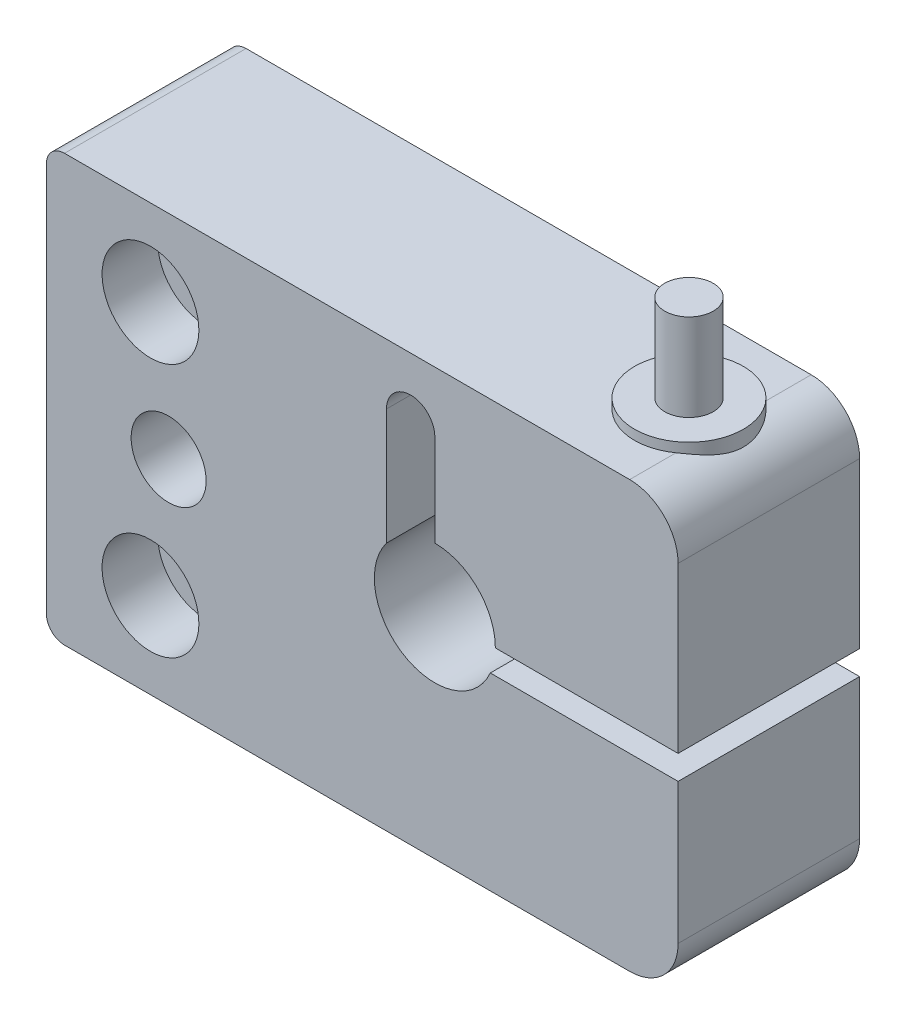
ISO-10303-21;
HEADER;
FILE_DESCRIPTION(('STEP AP214'),'2;1');
FILE_NAME('part.step','',(''),(''),'','','');
FILE_SCHEMA(('AUTOMOTIVE_DESIGN { 1 0 10303 214 1 1 1 1 }'));
ENDSEC;
DATA;
#1=APPLICATION_CONTEXT('core data for automotive mechanical design processes');
#2=APPLICATION_PROTOCOL_DEFINITION('international standard','automotive_design',2000,#1);
#3=PRODUCT_CONTEXT('',#1,'mechanical');
#4=PRODUCT('Part','Part','',(#3));
#5=PRODUCT_RELATED_PRODUCT_CATEGORY('part','',(#4));
#6=PRODUCT_DEFINITION_FORMATION('','',#4);
#7=PRODUCT_DEFINITION_CONTEXT('part definition',#1,'design');
#8=PRODUCT_DEFINITION('design','',#6,#7);
#9=PRODUCT_DEFINITION_SHAPE('','',#8);
#10=(LENGTH_UNIT() NAMED_UNIT(*) SI_UNIT(.MILLI.,.METRE.));
#11=(NAMED_UNIT(*) PLANE_ANGLE_UNIT() SI_UNIT($,.RADIAN.));
#12=(NAMED_UNIT(*) SI_UNIT($,.STERADIAN.) SOLID_ANGLE_UNIT());
#13=UNCERTAINTY_MEASURE_WITH_UNIT(LENGTH_MEASURE(1.E-05),#10,'distance_accuracy_value','');
#14=(GEOMETRIC_REPRESENTATION_CONTEXT(3) GLOBAL_UNCERTAINTY_ASSIGNED_CONTEXT((#13)) GLOBAL_UNIT_ASSIGNED_CONTEXT((#10,
#11,#12)) REPRESENTATION_CONTEXT('',''));
#15=CARTESIAN_POINT('',(0.,0.,0.));
#16=DIRECTION('',(0.,0.,1.));
#17=DIRECTION('',(1.,0.,0.));
#18=AXIS2_PLACEMENT_3D('',#15,#16,#17);
#19=CARTESIAN_POINT('',(13.5,-9.4,7.5));
#20=DIRECTION('',(0.,1.,0.));
#21=DIRECTION('',(-1.,0.,0.));
#22=AXIS2_PLACEMENT_3D('',#19,#20,#21);
#23=CYLINDRICAL_SURFACE('',#22,2.);
#24=CARTESIAN_POINT('',(13.5,-2.,7.5));
#25=DIRECTION('',(0.,-1.,0.));
#26=DIRECTION('',(1.,0.,0.));
#27=AXIS2_PLACEMENT_3D('',#24,#25,#26);
#28=CIRCLE('',#27,2.);
#29=CARTESIAN_POINT('',(15.5,-2.,7.5));
#30=VERTEX_POINT('',#29);
#31=EDGE_CURVE('E1067',#30,#30,#28,.T.);
#32=ORIENTED_EDGE('',*,*,#31,.F.);
#33=EDGE_LOOP('',(#32));
#34=FACE_BOUND('',#33,.T.);
#35=CARTESIAN_POINT('',(13.5,0.,7.5));
#36=DIRECTION('',(0.,1.,0.));
#37=DIRECTION('',(-1.,0.,0.));
#38=AXIS2_PLACEMENT_3D('',#35,#36,#37);
#39=CIRCLE('',#38,2.);
#40=CARTESIAN_POINT('',(11.5,0.,7.5));
#41=VERTEX_POINT('',#40);
#42=EDGE_CURVE('E1009',#41,#41,#39,.F.);
#43=ORIENTED_EDGE('',*,*,#42,.T.);
#44=EDGE_LOOP('',(#43));
#45=FACE_BOUND('',#44,.T.);
#46=ADVANCED_FACE('F14',(#34,#45),#23,.T.);
#47=CARTESIAN_POINT('',(13.5,-16.525,7.5));
#48=DIRECTION('',(0.,-1.,0.));
#49=DIRECTION('',(0.,0.,1.));
#50=AXIS2_PLACEMENT_3D('',#47,#48,#49);
#51=CYLINDRICAL_SURFACE('',#50,4.5);
#52=CARTESIAN_POINT('',(13.5,17.6,7.5));
#53=DIRECTION('',(0.,-1.,0.));
#54=DIRECTION('',(0.,0.,1.));
#55=AXIS2_PLACEMENT_3D('',#52,#53,#54);
#56=CIRCLE('',#55,4.5);
#57=CARTESIAN_POINT('',(16.1,17.6,3.8271264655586));
#58=VERTEX_POINT('',#57);
#59=CARTESIAN_POINT('',(16.1,17.6,11.1728735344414));
#60=VERTEX_POINT('',#59);
#61=EDGE_CURVE('E1077',#58,#60,#56,.F.);
#62=ORIENTED_EDGE('',*,*,#61,.T.);
#63=CARTESIAN_POINT('',(16.1,17.6,11.1728735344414));
#64=CARTESIAN_POINT('',(16.1978807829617,17.6000059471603,11.1036095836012));
#65=CARTESIAN_POINT('',(16.2929031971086,17.5964086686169,11.0304481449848));
#66=CARTESIAN_POINT('',(16.476473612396,17.5833037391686,10.8771050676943));
#67=CARTESIAN_POINT('',(16.5650298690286,17.5738037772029,10.7969326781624));
#68=CARTESIAN_POINT('',(16.7347925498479,17.5502350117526,10.6305269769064));
#69=CARTESIAN_POINT('',(16.8160296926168,17.5361865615,10.5443219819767));
#70=CARTESIAN_POINT('',(16.9712038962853,17.5047757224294,10.3661314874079));
#71=CARTESIAN_POINT('',(17.0451385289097,17.4874122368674,10.2741440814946));
#72=CARTESIAN_POINT('',(17.2548403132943,17.4323828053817,9.99120379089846));
#73=CARTESIAN_POINT('',(17.3793927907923,17.3916296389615,9.7923980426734));
#74=CARTESIAN_POINT('',(17.5964073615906,17.3113653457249,9.37732760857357));
#75=CARTESIAN_POINT('',(17.6888192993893,17.2718562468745,9.1610362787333));
#76=CARTESIAN_POINT('',(17.8050528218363,17.2186753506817,8.81645713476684));
#77=CARTESIAN_POINT('',(17.8409790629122,17.2014088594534,8.69271012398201));
#78=CARTESIAN_POINT('',(17.9021779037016,17.1711805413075,8.44205128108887));
#79=CARTESIAN_POINT('',(17.9274502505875,17.1582188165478,8.3151393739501));
#80=CARTESIAN_POINT('',(17.9669669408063,17.1376448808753,8.05939431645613));
#81=CARTESIAN_POINT('',(17.9812295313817,17.1300238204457,7.93056470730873));
#82=CARTESIAN_POINT('',(17.9985800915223,17.120723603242,7.67194598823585));
#83=CARTESIAN_POINT('',(18.001669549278,17.1190436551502,7.54215700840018));
#84=CARTESIAN_POINT('',(17.9968936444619,17.1216181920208,7.29646259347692));
#85=CARTESIAN_POINT('',(17.990142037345,17.1252694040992,7.18052715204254));
#86=CARTESIAN_POINT('',(17.9677380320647,17.1371903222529,6.94976906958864));
#87=CARTESIAN_POINT('',(17.9520861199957,17.1454597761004,6.83494636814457));
#88=CARTESIAN_POINT('',(17.9120421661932,17.166091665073,6.60709672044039));
#89=CARTESIAN_POINT('',(17.887641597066,17.1784580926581,6.49407163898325));
#90=CARTESIAN_POINT('',(17.8303460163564,17.2065097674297,6.27060020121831));
#91=CARTESIAN_POINT('',(17.797447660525,17.2221963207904,6.16015487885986));
#92=CARTESIAN_POINT('',(17.6864069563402,17.2728701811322,5.83362165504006));
#93=CARTESIAN_POINT('',(17.5958929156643,17.3114869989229,5.62219027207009));
#94=CARTESIAN_POINT('',(17.3840197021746,17.3899852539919,5.21595982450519));
#95=CARTESIAN_POINT('',(17.2626915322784,17.4298653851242,5.02114430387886));
#96=CARTESIAN_POINT('',(17.0562728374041,17.4846998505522,4.74007453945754));
#97=CARTESIAN_POINT('',(16.9816780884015,17.5024408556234,4.64653368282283));
#98=CARTESIAN_POINT('',(16.8249623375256,17.5345679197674,4.46537272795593));
#99=CARTESIAN_POINT('',(16.742843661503,17.5489550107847,4.37775081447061));
#100=CARTESIAN_POINT('',(16.5711129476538,17.5731091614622,4.20867357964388));
#101=CARTESIAN_POINT('',(16.481469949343,17.5828559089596,4.12724665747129));
#102=CARTESIAN_POINT('',(16.2955371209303,17.5963083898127,3.97158029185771));
#103=CARTESIAN_POINT('',(16.1992387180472,17.6000061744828,3.89735042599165));
#104=CARTESIAN_POINT('',(16.1,17.6,3.8271264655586));
#105=B_SPLINE_CURVE_WITH_KNOTS('',3,(#63,#64,#65,#66,#67,#68,#69,#70,#71,#72,#73,#74,#75,#76,
#77,#78,#79,#80,#81,#82,#83,#84,#85,#86,#87,#88,#89,#90,#91,#92,#93,#94,#95,#96,#97,#98,#99,
#100,#101,#102,#103,#104),.UNSPECIFIED.,.F.,.F.,(4,2,2,2,2,2,2,2,2,2,2,2,2,2,2,2,2,2,2,2,4),(0.,
0.359457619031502,0.718447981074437,1.07585366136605,1.43337779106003,2.14470503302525,
2.85713737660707,3.24669624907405,3.63626436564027,4.02518542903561,4.41405468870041,
4.76218471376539,5.110295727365,5.45874697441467,5.80733556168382,6.50406991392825,
7.20010602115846,7.56260208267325,7.92498646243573,8.28894284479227,8.65337710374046),.UNSPECIFIED.);
#106=EDGE_CURVE('E995',#60,#58,#105,.T.);
#107=ORIENTED_EDGE('',*,*,#106,.T.);
#108=EDGE_LOOP('',(#62,#107));
#109=FACE_BOUND('',#108,.T.);
#110=CARTESIAN_POINT('',(13.5,18.4,7.5));
#111=DIRECTION('',(0.,-1.,0.));
#112=DIRECTION('',(0.,0.,1.));
#113=AXIS2_PLACEMENT_3D('',#110,#111,#112);
#114=CIRCLE('',#113,4.5);
#115=CARTESIAN_POINT('',(13.5,18.4,12.));
#116=VERTEX_POINT('',#115);
#117=EDGE_CURVE('E24',#116,#116,#114,.T.);
#118=ORIENTED_EDGE('',*,*,#117,.T.);
#119=EDGE_LOOP('',(#118));
#120=FACE_BOUND('',#119,.T.);
#121=ADVANCED_FACE('F16',(#109,#120),#51,.T.);
#122=CARTESIAN_POINT('',(11.35,18.4,7.5));
#123=DIRECTION('',(0.,-1.,0.));
#124=DIRECTION('',(0.,0.,1.));
#125=AXIS2_PLACEMENT_3D('',#122,#123,#124);
#126=PLANE('',#125);
#127=ORIENTED_EDGE('',*,*,#117,.F.);
#128=EDGE_LOOP('',(#127));
#129=FACE_BOUND('',#128,.T.);
#130=CARTESIAN_POINT('',(13.5,18.4,7.5));
#131=DIRECTION('',(0.,1.,0.));
#132=DIRECTION('',(0.,0.,-1.));
#133=AXIS2_PLACEMENT_3D('',#130,#131,#132);
#134=CIRCLE('',#133,2.);
#135=CARTESIAN_POINT('',(13.5,18.4,5.5));
#136=VERTEX_POINT('',#135);
#137=EDGE_CURVE('E9',#136,#136,#134,.F.);
#138=ORIENTED_EDGE('',*,*,#137,.T.);
#139=EDGE_LOOP('',(#138));
#140=FACE_BOUND('',#139,.T.);
#141=ADVANCED_FACE('F1045',(#129,#140),#126,.F.);
#142=CARTESIAN_POINT('',(-23.5,10.5,10.4));
#143=DIRECTION('',(0.,0.,1.));
#144=DIRECTION('',(0.,1.,0.));
#145=AXIS2_PLACEMENT_3D('',#142,#143,#144);
#146=PLANE('',#145);
#147=CARTESIAN_POINT('',(-23.5,10.5,10.4));
#148=DIRECTION('',(0.,0.,1.));
#149=DIRECTION('',(0.,1.,0.));
#150=AXIS2_PLACEMENT_3D('',#147,#148,#149);
#151=CIRCLE('',#150,4.);
#152=CARTESIAN_POINT('',(-23.5,14.5,10.4));
#153=VERTEX_POINT('',#152);
#154=EDGE_CURVE('E1069',#153,#153,#151,.T.);
#155=ORIENTED_EDGE('',*,*,#154,.T.);
#156=EDGE_LOOP('',(#155));
#157=FACE_BOUND('',#156,.T.);
#158=CARTESIAN_POINT('',(-23.5,10.5,10.4));
#159=DIRECTION('',(0.,0.,1.));
#160=DIRECTION('',(-0.361644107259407,-0.932316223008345,0.));
#161=AXIS2_PLACEMENT_3D('',#158,#159,#160);
#162=CIRCLE('',#161,2.25);
#163=CARTESIAN_POINT('',(-24.3136992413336,8.4022884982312,10.4));
#164=VERTEX_POINT('',#163);
#165=CARTESIAN_POINT('',(-23.5,8.25,10.4));
#166=VERTEX_POINT('',#165);
#167=EDGE_CURVE('E915',#164,#166,#162,.T.);
#168=ORIENTED_EDGE('',*,*,#167,.F.);
#169=CARTESIAN_POINT('',(-23.5,10.5,10.4));
#170=DIRECTION('',(0.,0.,1.));
#171=DIRECTION('',(-0.703139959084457,-0.711051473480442,0.));
#172=AXIS2_PLACEMENT_3D('',#169,#170,#171);
#173=CIRCLE('',#172,2.25);
#174=CARTESIAN_POINT('',(-25.0820649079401,8.900134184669,10.4));
#175=VERTEX_POINT('',#174);
#176=EDGE_CURVE('E926',#175,#164,#173,.T.);
#177=ORIENTED_EDGE('',*,*,#176,.F.);
#178=CARTESIAN_POINT('',(-23.5,10.5,10.4));
#179=DIRECTION('',(0.,0.,1.));
#180=DIRECTION('',(-0.927801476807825,-0.373074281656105,0.));
#181=AXIS2_PLACEMENT_3D('',#178,#179,#180);
#182=CIRCLE('',#181,2.25);
#183=CARTESIAN_POINT('',(-25.5875533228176,9.66058286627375,10.4));
#184=VERTEX_POINT('',#183);
#185=EDGE_CURVE('E937',#184,#175,#182,.T.);
#186=ORIENTED_EDGE('',*,*,#185,.F.);
#187=CARTESIAN_POINT('',(-23.5,10.5,10.4));
#188=DIRECTION('',(0.,0.,1.));
#189=DIRECTION('',(-0.999979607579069,-0.00638626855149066,0.));
#190=AXIS2_PLACEMENT_3D('',#187,#188,#189);
#191=CIRCLE('',#190,2.25);
#192=CARTESIAN_POINT('',(-25.7499541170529,10.4856308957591,10.4));
#193=VERTEX_POINT('',#192);
#194=EDGE_CURVE('E948',#193,#184,#191,.T.);
#195=ORIENTED_EDGE('',*,*,#194,.F.);
#196=CARTESIAN_POINT('',(-23.5,10.5,10.4));
#197=DIRECTION('',(0.,0.,1.));
#198=DIRECTION('',(-0.932057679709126,0.362309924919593,0.));
#199=AXIS2_PLACEMENT_3D('',#196,#197,#198);
#200=CIRCLE('',#199,2.25);
#201=CARTESIAN_POINT('',(-25.5971297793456,11.3151973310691,10.4));
#202=VERTEX_POINT('',#201);
#203=EDGE_CURVE('E959',#202,#193,#200,.T.);
#204=ORIENTED_EDGE('',*,*,#203,.F.);
#205=CARTESIAN_POINT('',(-23.5,10.5,10.4));
#206=DIRECTION('',(0.,0.,1.));
#207=DIRECTION('',(-0.711051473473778,0.703139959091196,0.));
#208=AXIS2_PLACEMENT_3D('',#205,#206,#207);
#209=CIRCLE('',#208,2.25);
#210=CARTESIAN_POINT('',(-25.099865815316,12.0820649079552,10.4));
#211=VERTEX_POINT('',#210);
#212=EDGE_CURVE('E970',#211,#202,#209,.T.);
#213=ORIENTED_EDGE('',*,*,#212,.F.);
#214=CARTESIAN_POINT('',(-23.5,10.5,10.4));
#215=DIRECTION('',(0.,0.,1.));
#216=DIRECTION('',(-0.373074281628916,0.927801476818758,0.));
#217=AXIS2_PLACEMENT_3D('',#214,#215,#216);
#218=CIRCLE('',#217,2.25);
#219=CARTESIAN_POINT('',(-24.3394171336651,12.5875533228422,10.4));
#220=VERTEX_POINT('',#219);
#221=EDGE_CURVE('E981',#220,#211,#218,.T.);
#222=ORIENTED_EDGE('',*,*,#221,.F.);
#223=CARTESIAN_POINT('',(-23.5,10.5,10.4));
#224=DIRECTION('',(0.,0.,1.));
#225=DIRECTION('',(0.,1.,0.));
#226=AXIS2_PLACEMENT_3D('',#223,#224,#225);
#227=CIRCLE('',#226,2.25);
#228=CARTESIAN_POINT('',(-23.5,12.75,10.4));
#229=VERTEX_POINT('',#228);
#230=EDGE_CURVE('E991',#229,#220,#227,.T.);
#231=ORIENTED_EDGE('',*,*,#230,.F.);
#232=CARTESIAN_POINT('',(-23.5,10.5,10.4));
#233=DIRECTION('',(0.,0.,1.));
#234=DIRECTION('',(0.361644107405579,0.932316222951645,0.));
#235=AXIS2_PLACEMENT_3D('',#232,#233,#234);
#236=CIRCLE('',#235,2.25);
#237=CARTESIAN_POINT('',(-22.6863013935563,12.597709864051,10.4));
#238=VERTEX_POINT('',#237);
#239=EDGE_CURVE('E829',#238,#229,#236,.T.);
#240=ORIENTED_EDGE('',*,*,#239,.F.);
#241=CARTESIAN_POINT('',(-23.5,10.5,10.4));
#242=DIRECTION('',(0.,0.,1.));
#243=DIRECTION('',(0.7031399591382,0.711051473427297,0.));
#244=AXIS2_PLACEMENT_3D('',#241,#242,#243);
#245=CIRCLE('',#244,2.25);
#246=CARTESIAN_POINT('',(-21.9179350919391,12.0998658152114,10.4));
#247=VERTEX_POINT('',#246);
#248=EDGE_CURVE('E41',#247,#238,#245,.T.);
#249=ORIENTED_EDGE('',*,*,#248,.F.);
#250=CARTESIAN_POINT('',(-23.5,10.5,10.4));
#251=DIRECTION('',(0.,0.,1.));
#252=DIRECTION('',(0.927801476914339,0.373074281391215,0.));
#253=AXIS2_PLACEMENT_3D('',#250,#251,#252);
#254=CIRCLE('',#253,2.25);
#255=CARTESIAN_POINT('',(-21.4124466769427,11.3394171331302,10.4));
#256=VERTEX_POINT('',#255);
#257=EDGE_CURVE('E849',#256,#247,#254,.T.);
#258=ORIENTED_EDGE('',*,*,#257,.F.);
#259=CARTESIAN_POINT('',(-23.5,10.5,10.4));
#260=DIRECTION('',(0.,0.,1.));
#261=DIRECTION('',(0.999979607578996,0.00638626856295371,0.));
#262=AXIS2_PLACEMENT_3D('',#259,#260,#261);
#263=CIRCLE('',#262,2.25);
#264=CARTESIAN_POINT('',(-21.2500458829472,10.5143691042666,10.4));
#265=VERTEX_POINT('',#264);
#266=EDGE_CURVE('E860',#265,#256,#263,.T.);
#267=ORIENTED_EDGE('',*,*,#266,.F.);
#268=CARTESIAN_POINT('',(-23.5,10.5,10.4));
#269=DIRECTION('',(0.,0.,1.));
#270=DIRECTION('',(0.932057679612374,-0.362309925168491,0.));
#271=AXIS2_PLACEMENT_3D('',#268,#269,#270);
#272=CIRCLE('',#271,2.25);
#273=CARTESIAN_POINT('',(-21.4028702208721,9.6848026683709,10.4));
#274=VERTEX_POINT('',#273);
#275=EDGE_CURVE('E871',#274,#265,#272,.T.);
#276=ORIENTED_EDGE('',*,*,#275,.F.);
#277=CARTESIAN_POINT('',(-23.5,10.5,10.4));
#278=DIRECTION('',(0.,0.,1.));
#279=DIRECTION('',(0.711051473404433,-0.703139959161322,0.));
#280=AXIS2_PLACEMENT_3D('',#277,#278,#279);
#281=CIRCLE('',#280,2.25);
#282=CARTESIAN_POINT('',(-21.90013418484,8.91793509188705,10.4));
#283=VERTEX_POINT('',#282);
#284=EDGE_CURVE('E882',#283,#274,#281,.T.);
#285=ORIENTED_EDGE('',*,*,#284,.F.);
#286=CARTESIAN_POINT('',(-23.5,10.5,10.4));
#287=DIRECTION('',(0.,0.,1.));
#288=DIRECTION('',(0.373074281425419,-0.927801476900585,0.));
#289=AXIS2_PLACEMENT_3D('',#286,#287,#288);
#290=CIRCLE('',#289,2.25);
#291=CARTESIAN_POINT('',(-22.6605828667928,8.4124466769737,10.4));
#292=VERTEX_POINT('',#291);
#293=EDGE_CURVE('E893',#292,#283,#290,.T.);
#294=ORIENTED_EDGE('',*,*,#293,.F.);
#295=CARTESIAN_POINT('',(-23.5,10.5,10.4));
#296=DIRECTION('',(0.,0.,1.));
#297=DIRECTION('',(0.,-1.,0.));
#298=AXIS2_PLACEMENT_3D('',#295,#296,#297);
#299=CIRCLE('',#298,2.25);
#300=EDGE_CURVE('E904',#166,#292,#299,.T.);
#301=ORIENTED_EDGE('',*,*,#300,.F.);
#302=EDGE_LOOP('',(#168,#177,#186,#195,#204,#213,#222,#231,#240,#249,#258,#267,#276,#285,#294,#301));
#303=FACE_BOUND('',#302,.T.);
#304=ADVANCED_FACE('F389',(#157,#303),#146,.T.);
#305=CARTESIAN_POINT('',(-23.5,-10.5,10.4));
#306=DIRECTION('',(0.,0.,1.));
#307=DIRECTION('',(0.,1.,0.));
#308=AXIS2_PLACEMENT_3D('',#305,#306,#307);
#309=PLANE('',#308);
#310=CARTESIAN_POINT('',(-23.5,-10.5,10.4));
#311=DIRECTION('',(0.,0.,1.));
#312=DIRECTION('',(0.,1.,0.));
#313=AXIS2_PLACEMENT_3D('',#310,#311,#312);
#314=CIRCLE('',#313,4.);
#315=CARTESIAN_POINT('',(-23.5,-6.5,10.4));
#316=VERTEX_POINT('',#315);
#317=EDGE_CURVE('E1073',#316,#316,#314,.T.);
#318=ORIENTED_EDGE('',*,*,#317,.T.);
#319=EDGE_LOOP('',(#318));
#320=FACE_BOUND('',#319,.T.);
#321=CARTESIAN_POINT('',(-23.5,-10.5,10.4));
#322=DIRECTION('',(0.,0.,1.));
#323=DIRECTION('',(-0.361644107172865,-0.932316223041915,0.));
#324=AXIS2_PLACEMENT_3D('',#321,#322,#323);
#325=CIRCLE('',#324,2.25);
#326=CARTESIAN_POINT('',(-24.3136992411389,-12.5977115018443,10.4));
#327=VERTEX_POINT('',#326);
#328=CARTESIAN_POINT('',(-23.5,-12.75,10.4));
#329=VERTEX_POINT('',#328);
#330=EDGE_CURVE('E433',#327,#329,#325,.T.);
#331=ORIENTED_EDGE('',*,*,#330,.F.);
#332=CARTESIAN_POINT('',(-23.5,-10.5,10.4));
#333=DIRECTION('',(0.,0.,1.));
#334=DIRECTION('',(-0.703139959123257,-0.711051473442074,0.));
#335=AXIS2_PLACEMENT_3D('',#332,#333,#334);
#336=CIRCLE('',#335,2.25);
#337=CARTESIAN_POINT('',(-25.0820649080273,-12.0998658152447,10.4));
#338=VERTEX_POINT('',#337);
#339=EDGE_CURVE('E436',#338,#327,#336,.T.);
#340=ORIENTED_EDGE('',*,*,#339,.F.);
#341=CARTESIAN_POINT('',(-23.5,-10.5,10.4));
#342=DIRECTION('',(0.,0.,1.));
#343=DIRECTION('',(-0.927801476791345,-0.373074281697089,0.));
#344=AXIS2_PLACEMENT_3D('',#341,#342,#343);
#345=CIRCLE('',#344,2.25);
#346=CARTESIAN_POINT('',(-25.5875533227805,-11.3394171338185,10.4));
#347=VERTEX_POINT('',#346);
#348=EDGE_CURVE('E439',#347,#338,#345,.T.);
#349=ORIENTED_EDGE('',*,*,#348,.F.);
#350=CARTESIAN_POINT('',(-23.5,-10.5,10.4));
#351=DIRECTION('',(0.,0.,1.));
#352=DIRECTION('',(-0.99997960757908,-0.00638626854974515,0.));
#353=AXIS2_PLACEMENT_3D('',#350,#351,#352);
#354=CIRCLE('',#353,2.25);
#355=CARTESIAN_POINT('',(-25.7499541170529,-10.5143691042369,10.4));
#356=VERTEX_POINT('',#355);
#357=EDGE_CURVE('E442',#356,#347,#354,.T.);
#358=ORIENTED_EDGE('',*,*,#357,.F.);
#359=CARTESIAN_POINT('',(-23.5,-10.5,10.4));
#360=DIRECTION('',(0.,0.,1.));
#361=DIRECTION('',(-0.932057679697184,0.362309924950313,0.));
#362=AXIS2_PLACEMENT_3D('',#359,#360,#361);
#363=CIRCLE('',#362,2.25);
#364=CARTESIAN_POINT('',(-25.5971297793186,-9.6848026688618,10.4));
#365=VERTEX_POINT('',#364);
#366=EDGE_CURVE('E445',#365,#356,#363,.T.);
#367=ORIENTED_EDGE('',*,*,#366,.F.);
#368=CARTESIAN_POINT('',(-23.5,-10.5,10.4));
#369=DIRECTION('',(0.,0.,1.));
#370=DIRECTION('',(-0.711051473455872,0.703139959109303,0.));
#371=AXIS2_PLACEMENT_3D('',#368,#369,#370);
#372=CIRCLE('',#371,2.25);
#373=CARTESIAN_POINT('',(-25.0998658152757,-8.91793509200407,10.4));
#374=VERTEX_POINT('',#373);
#375=EDGE_CURVE('E447',#374,#365,#372,.T.);
#376=ORIENTED_EDGE('',*,*,#375,.F.);
#377=CARTESIAN_POINT('',(-23.5,-10.5,10.4));
#378=DIRECTION('',(0.,0.,1.));
#379=DIRECTION('',(-0.373074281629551,0.927801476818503,0.));
#380=AXIS2_PLACEMENT_3D('',#377,#378,#379);
#381=CIRCLE('',#380,2.25);
#382=CARTESIAN_POINT('',(-24.3394171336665,-8.41244667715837,10.4));
#383=VERTEX_POINT('',#382);
#384=EDGE_CURVE('E448',#383,#374,#381,.T.);
#385=ORIENTED_EDGE('',*,*,#384,.F.);
#386=CARTESIAN_POINT('',(-23.5,-10.5,10.4));
#387=DIRECTION('',(0.,0.,1.));
#388=DIRECTION('',(0.,1.,0.));
#389=AXIS2_PLACEMENT_3D('',#386,#387,#388);
#390=CIRCLE('',#389,2.25);
#391=CARTESIAN_POINT('',(-23.5,-8.25,10.4));
#392=VERTEX_POINT('',#391);
#393=EDGE_CURVE('E449',#392,#383,#390,.T.);
#394=ORIENTED_EDGE('',*,*,#393,.F.);
#395=CARTESIAN_POINT('',(-23.5,-10.5,10.4));
#396=DIRECTION('',(0.,0.,1.));
#397=DIRECTION('',(0.361644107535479,0.932316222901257,0.));
#398=AXIS2_PLACEMENT_3D('',#395,#396,#397);
#399=CIRCLE('',#398,2.25);
#400=CARTESIAN_POINT('',(-22.686301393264,-8.40229013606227,10.4));
#401=VERTEX_POINT('',#400);
#402=EDGE_CURVE('E468',#401,#392,#399,.T.);
#403=ORIENTED_EDGE('',*,*,#402,.F.);
#404=CARTESIAN_POINT('',(-23.5,-10.5,10.4));
#405=DIRECTION('',(0.,0.,1.));
#406=DIRECTION('',(0.703139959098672,0.711051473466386,0.));
#407=AXIS2_PLACEMENT_3D('',#404,#405,#406);
#408=CIRCLE('',#407,2.25);
#409=CARTESIAN_POINT('',(-21.917935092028,-8.90013418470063,10.4));
#410=VERTEX_POINT('',#409);
#411=EDGE_CURVE('E32',#410,#401,#408,.T.);
#412=ORIENTED_EDGE('',*,*,#411,.F.);
#413=CARTESIAN_POINT('',(-23.5,-10.5,10.4));
#414=DIRECTION('',(0.,0.,1.));
#415=DIRECTION('',(0.927801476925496,0.373074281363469,0.));
#416=AXIS2_PLACEMENT_3D('',#413,#414,#415);
#417=CIRCLE('',#416,2.25);
#418=CARTESIAN_POINT('',(-21.4124466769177,-9.66058286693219,10.4));
#419=VERTEX_POINT('',#418);
#420=EDGE_CURVE('E465',#419,#410,#417,.T.);
#421=ORIENTED_EDGE('',*,*,#420,.F.);
#422=CARTESIAN_POINT('',(-23.5,-10.5,10.4));
#423=DIRECTION('',(0.,0.,1.));
#424=DIRECTION('',(0.999979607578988,0.00638626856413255,0.));
#425=AXIS2_PLACEMENT_3D('',#422,#423,#424);
#426=CIRCLE('',#425,2.25);
#427=CARTESIAN_POINT('',(-21.2500458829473,-10.4856308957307,10.4));
#428=VERTEX_POINT('',#427);
#429=EDGE_CURVE('E463',#428,#419,#426,.T.);
#430=ORIENTED_EDGE('',*,*,#429,.F.);
#431=CARTESIAN_POINT('',(-23.5,-10.5,10.4));
#432=DIRECTION('',(0.,0.,1.));
#433=DIRECTION('',(0.932057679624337,-0.362309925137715,0.));
#434=AXIS2_PLACEMENT_3D('',#431,#432,#433);
#435=CIRCLE('',#434,2.25);
#436=CARTESIAN_POINT('',(-21.4028702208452,-11.3151973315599,10.4));
#437=VERTEX_POINT('',#436);
#438=EDGE_CURVE('E461',#437,#428,#435,.T.);
#439=ORIENTED_EDGE('',*,*,#438,.F.);
#440=CARTESIAN_POINT('',(-23.5,-10.5,10.4));
#441=DIRECTION('',(0.,0.,1.));
#442=DIRECTION('',(0.711051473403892,-0.703139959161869,0.));
#443=AXIS2_PLACEMENT_3D('',#440,#441,#442);
#444=CIRCLE('',#443,2.25);
#445=CARTESIAN_POINT('',(-21.9001341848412,-12.0820649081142,10.4));
#446=VERTEX_POINT('',#445);
#447=EDGE_CURVE('E459',#446,#437,#444,.T.);
#448=ORIENTED_EDGE('',*,*,#447,.F.);
#449=CARTESIAN_POINT('',(-23.5,-10.5,10.4));
#450=DIRECTION('',(0.,0.,1.));
#451=DIRECTION('',(0.373074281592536,-0.927801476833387,0.));
#452=AXIS2_PLACEMENT_3D('',#449,#450,#451);
#453=CIRCLE('',#452,2.25);
#454=CARTESIAN_POINT('',(-22.6605828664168,-12.5875533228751,10.4));
#455=VERTEX_POINT('',#454);
#456=EDGE_CURVE('E427',#455,#446,#453,.T.);
#457=ORIENTED_EDGE('',*,*,#456,.F.);
#458=CARTESIAN_POINT('',(-23.5,-10.5,10.4));
#459=DIRECTION('',(0.,0.,1.));
#460=DIRECTION('',(0.,-1.,0.));
#461=AXIS2_PLACEMENT_3D('',#458,#459,#460);
#462=CIRCLE('',#461,2.25);
#463=EDGE_CURVE('E430',#329,#455,#462,.T.);
#464=ORIENTED_EDGE('',*,*,#463,.F.);
#465=EDGE_LOOP('',(#331,#340,#349,#358,#367,#376,#385,#394,#403,#412,#421,#430,#439,#448,#457,#464));
#466=FACE_BOUND('',#465,.T.);
#467=ADVANCED_FACE('F384',(#320,#466),#309,.T.);
#468=CARTESIAN_POINT('',(-23.5,10.5,10.4));
#469=DIRECTION('',(0.,0.,1.));
#470=DIRECTION('',(0.,1.,0.));
#471=AXIS2_PLACEMENT_3D('',#468,#469,#470);
#472=CYLINDRICAL_SURFACE('',#471,4.);
#473=CARTESIAN_POINT('',(-23.5,10.5,15.));
#474=DIRECTION('',(0.,0.,1.));
#475=DIRECTION('',(0.,1.,0.));
#476=AXIS2_PLACEMENT_3D('',#473,#474,#475);
#477=CIRCLE('',#476,4.);
#478=CARTESIAN_POINT('',(-23.5,14.5,15.));
#479=VERTEX_POINT('',#478);
#480=EDGE_CURVE('E1294',#479,#479,#477,.F.);
#481=ORIENTED_EDGE('',*,*,#480,.F.);
#482=EDGE_LOOP('',(#481));
#483=FACE_BOUND('',#482,.T.);
#484=ORIENTED_EDGE('',*,*,#154,.F.);
#485=EDGE_LOOP('',(#484));
#486=FACE_BOUND('',#485,.T.);
#487=ADVANCED_FACE('F381',(#483,#486),#472,.F.);
#488=CARTESIAN_POINT('',(-23.5,-10.5,10.4));
#489=DIRECTION('',(0.,0.,1.));
#490=DIRECTION('',(0.,1.,0.));
#491=AXIS2_PLACEMENT_3D('',#488,#489,#490);
#492=CYLINDRICAL_SURFACE('',#491,4.);
#493=CARTESIAN_POINT('',(-23.5,-10.5,15.));
#494=DIRECTION('',(0.,0.,1.));
#495=DIRECTION('',(0.,1.,0.));
#496=AXIS2_PLACEMENT_3D('',#493,#494,#495);
#497=CIRCLE('',#496,4.);
#498=CARTESIAN_POINT('',(-23.5,-6.5,15.));
#499=VERTEX_POINT('',#498);
#500=EDGE_CURVE('E1291',#499,#499,#497,.F.);
#501=ORIENTED_EDGE('',*,*,#500,.F.);
#502=EDGE_LOOP('',(#501));
#503=FACE_BOUND('',#502,.T.);
#504=ORIENTED_EDGE('',*,*,#317,.F.);
#505=EDGE_LOOP('',(#504));
#506=FACE_BOUND('',#505,.T.);
#507=ADVANCED_FACE('F375',(#503,#506),#492,.F.);
#508=CARTESIAN_POINT('',(-23.5,-10.5,4.6));
#509=DIRECTION('',(0.,0.,-1.));
#510=DIRECTION('',(0.,-1.,0.));
#511=AXIS2_PLACEMENT_3D('',#508,#509,#510);
#512=PLANE('',#511);
#513=CARTESIAN_POINT('',(-23.5,-10.5,4.6));
#514=DIRECTION('',(0.,0.,-1.));
#515=DIRECTION('',(0.,-1.,0.));
#516=AXIS2_PLACEMENT_3D('',#513,#514,#515);
#517=CIRCLE('',#516,4.);
#518=CARTESIAN_POINT('',(-23.5,-14.5,4.6));
#519=VERTEX_POINT('',#518);
#520=EDGE_CURVE('E1288',#519,#519,#517,.T.);
#521=ORIENTED_EDGE('',*,*,#520,.T.);
#522=EDGE_LOOP('',(#521));
#523=FACE_BOUND('',#522,.T.);
#524=CARTESIAN_POINT('',(-23.5,-8.25,4.6));
#525=CARTESIAN_POINT('',(-23.929417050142,-8.25020244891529,4.6));
#526=CARTESIAN_POINT('',(-24.3282130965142,-8.40797632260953,4.6));
#527=CARTESIAN_POINT('',(-24.7610338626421,-8.57921124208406,4.6));
#528=CARTESIAN_POINT('',(-25.0909902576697,-8.90900974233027,4.6));
#529=CARTESIAN_POINT('',(-25.4202012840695,-9.23806323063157,4.6));
#530=CARTESIAN_POINT('',(-25.5920236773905,-9.67178690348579,4.6));
#531=CARTESIAN_POINT('',(-25.749898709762,-10.0703038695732,4.6));
#532=CARTESIAN_POINT('',(-25.75,-10.5,4.6));
#533=CARTESIAN_POINT('',(-25.750101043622,-10.9286499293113,4.6));
#534=CARTESIAN_POINT('',(-25.5920236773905,-11.3282130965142,4.6));
#535=CARTESIAN_POINT('',(-25.4207887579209,-11.7610338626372,4.6));
#536=CARTESIAN_POINT('',(-25.0909902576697,-12.0909902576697,4.6));
#537=CARTESIAN_POINT('',(-24.7619367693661,-12.4202012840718,4.6));
#538=CARTESIAN_POINT('',(-24.3282130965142,-12.5920236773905,4.6));
#539=CARTESIAN_POINT('',(-23.9299521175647,-12.7497972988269,4.6));
#540=CARTESIAN_POINT('',(-23.5,-12.75,4.6));
#541=B_SPLINE_CURVE_WITH_KNOTS('',2,(#524,#525,#526,#527,#528,#529,#530,#531,#532,#533,#534,
#535,#536,#537,#538,#539,#540),.UNSPECIFIED.,.F.,.F.,(3,2,2,2,2,2,2,2,3),(0.,0.125,0.25,0.375,
0.5,0.625,0.75,0.875,1.),.UNSPECIFIED.);
#542=CARTESIAN_POINT('',(-23.5,-8.25,4.6));
#543=VERTEX_POINT('',#542);
#544=CARTESIAN_POINT('',(-24.3136992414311,-8.40228849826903,4.6));
#545=VERTEX_POINT('',#544);
#546=EDGE_CURVE('E469',#543,#545,#541,.T.);
#547=ORIENTED_EDGE('',*,*,#546,.T.);
#548=CARTESIAN_POINT('',(-23.5,-8.25,4.6));
#549=CARTESIAN_POINT('',(-23.929417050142,-8.25020244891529,4.6));
#550=CARTESIAN_POINT('',(-24.3282130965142,-8.40797632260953,4.6));
#551=CARTESIAN_POINT('',(-24.7610338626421,-8.57921124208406,4.6));
#552=CARTESIAN_POINT('',(-25.0909902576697,-8.90900974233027,4.6));
#553=CARTESIAN_POINT('',(-25.4202012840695,-9.23806323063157,4.6));
#554=CARTESIAN_POINT('',(-25.5920236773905,-9.67178690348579,4.6));
#555=CARTESIAN_POINT('',(-25.749898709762,-10.0703038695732,4.6));
#556=CARTESIAN_POINT('',(-25.75,-10.5,4.6));
#557=CARTESIAN_POINT('',(-25.750101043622,-10.9286499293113,4.6));
#558=CARTESIAN_POINT('',(-25.5920236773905,-11.3282130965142,4.6));
#559=CARTESIAN_POINT('',(-25.4207887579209,-11.7610338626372,4.6));
#560=CARTESIAN_POINT('',(-25.0909902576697,-12.0909902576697,4.6));
#561=CARTESIAN_POINT('',(-24.7619367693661,-12.4202012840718,4.6));
#562=CARTESIAN_POINT('',(-24.3282130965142,-12.5920236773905,4.6));
#563=CARTESIAN_POINT('',(-23.9299521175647,-12.7497972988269,4.6));
#564=CARTESIAN_POINT('',(-23.5,-12.75,4.6));
#565=B_SPLINE_CURVE_WITH_KNOTS('',2,(#548,#549,#550,#551,#552,#553,#554,#555,#556,#557,#558,
#559,#560,#561,#562,#563,#564),.UNSPECIFIED.,.F.,.F.,(3,2,2,2,2,2,2,2,3),(0.,0.125,0.25,0.375,
0.5,0.625,0.75,0.875,1.),.UNSPECIFIED.);
#566=CARTESIAN_POINT('',(-25.0820649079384,-8.90013418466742,4.6));
#567=VERTEX_POINT('',#566);
#568=EDGE_CURVE('E471',#545,#567,#565,.T.);
#569=ORIENTED_EDGE('',*,*,#568,.T.);
#570=CARTESIAN_POINT('',(-23.5,-8.25,4.6));
#571=CARTESIAN_POINT('',(-23.929417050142,-8.25020244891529,4.6));
#572=CARTESIAN_POINT('',(-24.3282130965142,-8.40797632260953,4.6));
#573=CARTESIAN_POINT('',(-24.7610338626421,-8.57921124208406,4.6));
#574=CARTESIAN_POINT('',(-25.0909902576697,-8.90900974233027,4.6));
#575=CARTESIAN_POINT('',(-25.4202012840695,-9.23806323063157,4.6));
#576=CARTESIAN_POINT('',(-25.5920236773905,-9.67178690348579,4.6));
#577=CARTESIAN_POINT('',(-25.749898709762,-10.0703038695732,4.6));
#578=CARTESIAN_POINT('',(-25.75,-10.5,4.6));
#579=CARTESIAN_POINT('',(-25.750101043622,-10.9286499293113,4.6));
#580=CARTESIAN_POINT('',(-25.5920236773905,-11.3282130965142,4.6));
#581=CARTESIAN_POINT('',(-25.4207887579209,-11.7610338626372,4.6));
#582=CARTESIAN_POINT('',(-25.0909902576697,-12.0909902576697,4.6));
#583=CARTESIAN_POINT('',(-24.7619367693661,-12.4202012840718,4.6));
#584=CARTESIAN_POINT('',(-24.3282130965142,-12.5920236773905,4.6));
#585=CARTESIAN_POINT('',(-23.9299521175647,-12.7497972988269,4.6));
#586=CARTESIAN_POINT('',(-23.5,-12.75,4.6));
#587=B_SPLINE_CURVE_WITH_KNOTS('',2,(#570,#571,#572,#573,#574,#575,#576,#577,#578,#579,#580,
#581,#582,#583,#584,#585,#586),.UNSPECIFIED.,.F.,.F.,(3,2,2,2,2,2,2,2,3),(0.,0.125,0.25,0.375,
0.5,0.625,0.75,0.875,1.),.UNSPECIFIED.);
#588=CARTESIAN_POINT('',(-25.5875533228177,-9.66058286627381,4.6));
#589=VERTEX_POINT('',#588);
#590=EDGE_CURVE('E474',#567,#589,#587,.T.);
#591=ORIENTED_EDGE('',*,*,#590,.T.);
#592=CARTESIAN_POINT('',(-23.5,-8.25,4.6));
#593=CARTESIAN_POINT('',(-23.929417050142,-8.25020244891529,4.6));
#594=CARTESIAN_POINT('',(-24.3282130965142,-8.40797632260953,4.6));
#595=CARTESIAN_POINT('',(-24.7610338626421,-8.57921124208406,4.6));
#596=CARTESIAN_POINT('',(-25.0909902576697,-8.90900974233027,4.6));
#597=CARTESIAN_POINT('',(-25.4202012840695,-9.23806323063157,4.6));
#598=CARTESIAN_POINT('',(-25.5920236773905,-9.67178690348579,4.6));
#599=CARTESIAN_POINT('',(-25.749898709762,-10.0703038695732,4.6));
#600=CARTESIAN_POINT('',(-25.75,-10.5,4.6));
#601=CARTESIAN_POINT('',(-25.750101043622,-10.9286499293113,4.6));
#602=CARTESIAN_POINT('',(-25.5920236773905,-11.3282130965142,4.6));
#603=CARTESIAN_POINT('',(-25.4207887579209,-11.7610338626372,4.6));
#604=CARTESIAN_POINT('',(-25.0909902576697,-12.0909902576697,4.6));
#605=CARTESIAN_POINT('',(-24.7619367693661,-12.4202012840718,4.6));
#606=CARTESIAN_POINT('',(-24.3282130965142,-12.5920236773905,4.6));
#607=CARTESIAN_POINT('',(-23.9299521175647,-12.7497972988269,4.6));
#608=CARTESIAN_POINT('',(-23.5,-12.75,4.6));
#609=B_SPLINE_CURVE_WITH_KNOTS('',2,(#592,#593,#594,#595,#596,#597,#598,#599,#600,#601,#602,
#603,#604,#605,#606,#607,#608),.UNSPECIFIED.,.F.,.F.,(3,2,2,2,2,2,2,2,3),(0.,0.125,0.25,0.375,
0.5,0.625,0.75,0.875,1.),.UNSPECIFIED.);
#610=CARTESIAN_POINT('',(-25.7499541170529,-10.4856308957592,4.6));
#611=VERTEX_POINT('',#610);
#612=EDGE_CURVE('E477',#589,#611,#609,.T.);
#613=ORIENTED_EDGE('',*,*,#612,.T.);
#614=CARTESIAN_POINT('',(-23.5,-8.25,4.6));
#615=CARTESIAN_POINT('',(-23.929417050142,-8.25020244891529,4.6));
#616=CARTESIAN_POINT('',(-24.3282130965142,-8.40797632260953,4.6));
#617=CARTESIAN_POINT('',(-24.7610338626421,-8.57921124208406,4.6));
#618=CARTESIAN_POINT('',(-25.0909902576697,-8.90900974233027,4.6));
#619=CARTESIAN_POINT('',(-25.4202012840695,-9.23806323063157,4.6));
#620=CARTESIAN_POINT('',(-25.5920236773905,-9.67178690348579,4.6));
#621=CARTESIAN_POINT('',(-25.749898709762,-10.0703038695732,4.6));
#622=CARTESIAN_POINT('',(-25.75,-10.5,4.6));
#623=CARTESIAN_POINT('',(-25.750101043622,-10.9286499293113,4.6));
#624=CARTESIAN_POINT('',(-25.5920236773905,-11.3282130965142,4.6));
#625=CARTESIAN_POINT('',(-25.4207887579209,-11.7610338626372,4.6));
#626=CARTESIAN_POINT('',(-25.0909902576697,-12.0909902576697,4.6));
#627=CARTESIAN_POINT('',(-24.7619367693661,-12.4202012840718,4.6));
#628=CARTESIAN_POINT('',(-24.3282130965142,-12.5920236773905,4.6));
#629=CARTESIAN_POINT('',(-23.9299521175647,-12.7497972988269,4.6));
#630=CARTESIAN_POINT('',(-23.5,-12.75,4.6));
#631=B_SPLINE_CURVE_WITH_KNOTS('',2,(#614,#615,#616,#617,#618,#619,#620,#621,#622,#623,#624,
#625,#626,#627,#628,#629,#630),.UNSPECIFIED.,.F.,.F.,(3,2,2,2,2,2,2,2,3),(0.,0.125,0.25,0.375,
0.5,0.625,0.75,0.875,1.),.UNSPECIFIED.);
#632=CARTESIAN_POINT('',(-25.5971297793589,-11.3151973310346,4.6));
#633=VERTEX_POINT('',#632);
#634=EDGE_CURVE('E480',#611,#633,#631,.T.);
#635=ORIENTED_EDGE('',*,*,#634,.T.);
#636=CARTESIAN_POINT('',(-23.5,-8.25,4.6));
#637=CARTESIAN_POINT('',(-23.929417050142,-8.25020244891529,4.6));
#638=CARTESIAN_POINT('',(-24.3282130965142,-8.40797632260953,4.6));
#639=CARTESIAN_POINT('',(-24.7610338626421,-8.57921124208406,4.6));
#640=CARTESIAN_POINT('',(-25.0909902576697,-8.90900974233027,4.6));
#641=CARTESIAN_POINT('',(-25.4202012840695,-9.23806323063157,4.6));
#642=CARTESIAN_POINT('',(-25.5920236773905,-9.67178690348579,4.6));
#643=CARTESIAN_POINT('',(-25.749898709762,-10.0703038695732,4.6));
#644=CARTESIAN_POINT('',(-25.75,-10.5,4.6));
#645=CARTESIAN_POINT('',(-25.750101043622,-10.9286499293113,4.6));
#646=CARTESIAN_POINT('',(-25.5920236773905,-11.3282130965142,4.6));
#647=CARTESIAN_POINT('',(-25.4207887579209,-11.7610338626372,4.6));
#648=CARTESIAN_POINT('',(-25.0909902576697,-12.0909902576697,4.6));
#649=CARTESIAN_POINT('',(-24.7619367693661,-12.4202012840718,4.6));
#650=CARTESIAN_POINT('',(-24.3282130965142,-12.5920236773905,4.6));
#651=CARTESIAN_POINT('',(-23.9299521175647,-12.7497972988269,4.6));
#652=CARTESIAN_POINT('',(-23.5,-12.75,4.6));
#653=B_SPLINE_CURVE_WITH_KNOTS('',2,(#636,#637,#638,#639,#640,#641,#642,#643,#644,#645,#646,
#647,#648,#649,#650,#651,#652),.UNSPECIFIED.,.F.,.F.,(3,2,2,2,2,2,2,2,3),(0.,0.125,0.25,0.375,
0.5,0.625,0.75,0.875,1.),.UNSPECIFIED.);
#654=CARTESIAN_POINT('',(-25.0998658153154,-12.0820649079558,4.6));
#655=VERTEX_POINT('',#654);
#656=EDGE_CURVE('E483',#633,#655,#653,.T.);
#657=ORIENTED_EDGE('',*,*,#656,.T.);
#658=CARTESIAN_POINT('',(-23.5,-8.25,4.6));
#659=CARTESIAN_POINT('',(-23.929417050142,-8.25020244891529,4.6));
#660=CARTESIAN_POINT('',(-24.3282130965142,-8.40797632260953,4.6));
#661=CARTESIAN_POINT('',(-24.7610338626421,-8.57921124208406,4.6));
#662=CARTESIAN_POINT('',(-25.0909902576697,-8.90900974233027,4.6));
#663=CARTESIAN_POINT('',(-25.4202012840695,-9.23806323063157,4.6));
#664=CARTESIAN_POINT('',(-25.5920236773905,-9.67178690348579,4.6));
#665=CARTESIAN_POINT('',(-25.749898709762,-10.0703038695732,4.6));
#666=CARTESIAN_POINT('',(-25.75,-10.5,4.6));
#667=CARTESIAN_POINT('',(-25.750101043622,-10.9286499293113,4.6));
#668=CARTESIAN_POINT('',(-25.5920236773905,-11.3282130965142,4.6));
#669=CARTESIAN_POINT('',(-25.4207887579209,-11.7610338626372,4.6));
#670=CARTESIAN_POINT('',(-25.0909902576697,-12.0909902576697,4.6));
#671=CARTESIAN_POINT('',(-24.7619367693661,-12.4202012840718,4.6));
#672=CARTESIAN_POINT('',(-24.3282130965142,-12.5920236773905,4.6));
#673=CARTESIAN_POINT('',(-23.9299521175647,-12.7497972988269,4.6));
#674=CARTESIAN_POINT('',(-23.5,-12.75,4.6));
#675=B_SPLINE_CURVE_WITH_KNOTS('',2,(#658,#659,#660,#661,#662,#663,#664,#665,#666,#667,#668,
#669,#670,#671,#672,#673,#674),.UNSPECIFIED.,.F.,.F.,(3,2,2,2,2,2,2,2,3),(0.,0.125,0.25,0.375,
0.5,0.625,0.75,0.875,1.),.UNSPECIFIED.);
#676=CARTESIAN_POINT('',(-24.3394171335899,-12.5875533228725,4.6));
#677=VERTEX_POINT('',#676);
#678=EDGE_CURVE('E486',#655,#677,#675,.T.);
#679=ORIENTED_EDGE('',*,*,#678,.T.);
#680=CARTESIAN_POINT('',(-23.5,-8.25,4.6));
#681=CARTESIAN_POINT('',(-23.929417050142,-8.25020244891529,4.6));
#682=CARTESIAN_POINT('',(-24.3282130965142,-8.40797632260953,4.6));
#683=CARTESIAN_POINT('',(-24.7610338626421,-8.57921124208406,4.6));
#684=CARTESIAN_POINT('',(-25.0909902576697,-8.90900974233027,4.6));
#685=CARTESIAN_POINT('',(-25.4202012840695,-9.23806323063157,4.6));
#686=CARTESIAN_POINT('',(-25.5920236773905,-9.67178690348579,4.6));
#687=CARTESIAN_POINT('',(-25.749898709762,-10.0703038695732,4.6));
#688=CARTESIAN_POINT('',(-25.75,-10.5,4.6));
#689=CARTESIAN_POINT('',(-25.750101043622,-10.9286499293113,4.6));
#690=CARTESIAN_POINT('',(-25.5920236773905,-11.3282130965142,4.6));
#691=CARTESIAN_POINT('',(-25.4207887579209,-11.7610338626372,4.6));
#692=CARTESIAN_POINT('',(-25.0909902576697,-12.0909902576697,4.6));
#693=CARTESIAN_POINT('',(-24.7619367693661,-12.4202012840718,4.6));
#694=CARTESIAN_POINT('',(-24.3282130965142,-12.5920236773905,4.6));
#695=CARTESIAN_POINT('',(-23.9299521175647,-12.7497972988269,4.6));
#696=CARTESIAN_POINT('',(-23.5,-12.75,4.6));
#697=B_SPLINE_CURVE_WITH_KNOTS('',2,(#680,#681,#682,#683,#684,#685,#686,#687,#688,#689,#690,
#691,#692,#693,#694,#695,#696),.UNSPECIFIED.,.F.,.F.,(3,2,2,2,2,2,2,2,3),(0.,0.125,0.25,0.375,
0.5,0.625,0.75,0.875,1.),.UNSPECIFIED.);
#698=CARTESIAN_POINT('',(-23.5,-12.75,4.6));
#699=VERTEX_POINT('',#698);
#700=EDGE_CURVE('E347',#677,#699,#697,.T.);
#701=ORIENTED_EDGE('',*,*,#700,.T.);
#702=CARTESIAN_POINT('',(-23.5,-12.75,4.6));
#703=CARTESIAN_POINT('',(-23.0705829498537,-12.7497975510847,4.6));
#704=CARTESIAN_POINT('',(-22.6717869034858,-12.5920236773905,4.6));
#705=CARTESIAN_POINT('',(-22.2389661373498,-12.4207887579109,4.6));
#706=CARTESIAN_POINT('',(-21.9090097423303,-12.0909902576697,4.6));
#707=CARTESIAN_POINT('',(-21.5797987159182,-11.7619367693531,4.6));
#708=CARTESIAN_POINT('',(-21.4079763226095,-11.3282130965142,4.6));
#709=CARTESIAN_POINT('',(-21.250101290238,-10.9296961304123,4.6));
#710=CARTESIAN_POINT('',(-21.25,-10.5,4.6));
#711=CARTESIAN_POINT('',(-21.249898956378,-10.0713500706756,4.6));
#712=CARTESIAN_POINT('',(-21.4079763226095,-9.67178690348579,4.6));
#713=CARTESIAN_POINT('',(-21.5792112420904,-9.23896613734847,4.6));
#714=CARTESIAN_POINT('',(-21.9090097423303,-8.90900974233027,4.6));
#715=CARTESIAN_POINT('',(-22.2380632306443,-8.5797987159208,4.6));
#716=CARTESIAN_POINT('',(-22.6717869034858,-8.40797632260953,4.6));
#717=CARTESIAN_POINT('',(-23.0700478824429,-8.25020270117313,4.6));
#718=CARTESIAN_POINT('',(-23.5,-8.25,4.6));
#719=B_SPLINE_CURVE_WITH_KNOTS('',2,(#702,#703,#704,#705,#706,#707,#708,#709,#710,#711,#712,
#713,#714,#715,#716,#717,#718),.UNSPECIFIED.,.F.,.F.,(3,2,2,2,2,2,2,2,3),(0.,0.125,0.25,0.375,
0.5,0.625,0.75,0.875,1.),.UNSPECIFIED.);
#720=CARTESIAN_POINT('',(-22.6863007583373,-12.5977115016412,4.6));
#721=VERTEX_POINT('',#720);
#722=EDGE_CURVE('E333',#699,#721,#719,.T.);
#723=ORIENTED_EDGE('',*,*,#722,.T.);
#724=CARTESIAN_POINT('',(-23.5,-12.75,4.6));
#725=CARTESIAN_POINT('',(-23.0705829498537,-12.7497975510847,4.6));
#726=CARTESIAN_POINT('',(-22.6717869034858,-12.5920236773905,4.6));
#727=CARTESIAN_POINT('',(-22.2389661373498,-12.4207887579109,4.6));
#728=CARTESIAN_POINT('',(-21.9090097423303,-12.0909902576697,4.6));
#729=CARTESIAN_POINT('',(-21.5797987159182,-11.7619367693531,4.6));
#730=CARTESIAN_POINT('',(-21.4079763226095,-11.3282130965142,4.6));
#731=CARTESIAN_POINT('',(-21.250101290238,-10.9296961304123,4.6));
#732=CARTESIAN_POINT('',(-21.25,-10.5,4.6));
#733=CARTESIAN_POINT('',(-21.249898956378,-10.0713500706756,4.6));
#734=CARTESIAN_POINT('',(-21.4079763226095,-9.67178690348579,4.6));
#735=CARTESIAN_POINT('',(-21.5792112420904,-9.23896613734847,4.6));
#736=CARTESIAN_POINT('',(-21.9090097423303,-8.90900974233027,4.6));
#737=CARTESIAN_POINT('',(-22.2380632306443,-8.5797987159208,4.6));
#738=CARTESIAN_POINT('',(-22.6717869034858,-8.40797632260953,4.6));
#739=CARTESIAN_POINT('',(-23.0700478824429,-8.25020270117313,4.6));
#740=CARTESIAN_POINT('',(-23.5,-8.25,4.6));
#741=B_SPLINE_CURVE_WITH_KNOTS('',2,(#724,#725,#726,#727,#728,#729,#730,#731,#732,#733,#734,
#735,#736,#737,#738,#739,#740),.UNSPECIFIED.,.F.,.F.,(3,2,2,2,2,2,2,2,3),(0.,0.125,0.25,0.375,
0.5,0.625,0.75,0.875,1.),.UNSPECIFIED.);
#742=CARTESIAN_POINT('',(-21.917935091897,-12.0998658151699,4.6));
#743=VERTEX_POINT('',#742);
#744=EDGE_CURVE('E329',#721,#743,#741,.T.);
#745=ORIENTED_EDGE('',*,*,#744,.T.);
#746=CARTESIAN_POINT('',(-23.5,-12.75,4.6));
#747=CARTESIAN_POINT('',(-23.0705829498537,-12.7497975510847,4.6));
#748=CARTESIAN_POINT('',(-22.6717869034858,-12.5920236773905,4.6));
#749=CARTESIAN_POINT('',(-22.2389661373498,-12.4207887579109,4.6));
#750=CARTESIAN_POINT('',(-21.9090097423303,-12.0909902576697,4.6));
#751=CARTESIAN_POINT('',(-21.5797987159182,-11.7619367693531,4.6));
#752=CARTESIAN_POINT('',(-21.4079763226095,-11.3282130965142,4.6));
#753=CARTESIAN_POINT('',(-21.250101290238,-10.9296961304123,4.6));
#754=CARTESIAN_POINT('',(-21.25,-10.5,4.6));
#755=CARTESIAN_POINT('',(-21.249898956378,-10.0713500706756,4.6));
#756=CARTESIAN_POINT('',(-21.4079763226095,-9.67178690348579,4.6));
#757=CARTESIAN_POINT('',(-21.5792112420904,-9.23896613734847,4.6));
#758=CARTESIAN_POINT('',(-21.9090097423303,-8.90900974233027,4.6));
#759=CARTESIAN_POINT('',(-22.2380632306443,-8.5797987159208,4.6));
#760=CARTESIAN_POINT('',(-22.6717869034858,-8.40797632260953,4.6));
#761=CARTESIAN_POINT('',(-23.0700478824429,-8.25020270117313,4.6));
#762=CARTESIAN_POINT('',(-23.5,-8.25,4.6));
#763=B_SPLINE_CURVE_WITH_KNOTS('',2,(#746,#747,#748,#749,#750,#751,#752,#753,#754,#755,#756,
#757,#758,#759,#760,#761,#762),.UNSPECIFIED.,.F.,.F.,(3,2,2,2,2,2,2,2,3),(0.,0.125,0.25,0.375,
0.5,0.625,0.75,0.875,1.),.UNSPECIFIED.);
#764=CARTESIAN_POINT('',(-21.4124466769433,-11.3394171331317,4.6));
#765=VERTEX_POINT('',#764);
#766=EDGE_CURVE('E337',#743,#765,#763,.T.);
#767=ORIENTED_EDGE('',*,*,#766,.T.);
#768=CARTESIAN_POINT('',(-23.5,-12.75,4.6));
#769=CARTESIAN_POINT('',(-23.0705829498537,-12.7497975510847,4.6));
#770=CARTESIAN_POINT('',(-22.6717869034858,-12.5920236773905,4.6));
#771=CARTESIAN_POINT('',(-22.2389661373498,-12.4207887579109,4.6));
#772=CARTESIAN_POINT('',(-21.9090097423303,-12.0909902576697,4.6));
#773=CARTESIAN_POINT('',(-21.5797987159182,-11.7619367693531,4.6));
#774=CARTESIAN_POINT('',(-21.4079763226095,-11.3282130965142,4.6));
#775=CARTESIAN_POINT('',(-21.250101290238,-10.9296961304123,4.6));
#776=CARTESIAN_POINT('',(-21.25,-10.5,4.6));
#777=CARTESIAN_POINT('',(-21.249898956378,-10.0713500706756,4.6));
#778=CARTESIAN_POINT('',(-21.4079763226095,-9.67178690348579,4.6));
#779=CARTESIAN_POINT('',(-21.5792112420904,-9.23896613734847,4.6));
#780=CARTESIAN_POINT('',(-21.9090097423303,-8.90900974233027,4.6));
#781=CARTESIAN_POINT('',(-22.2380632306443,-8.5797987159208,4.6));
#782=CARTESIAN_POINT('',(-22.6717869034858,-8.40797632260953,4.6));
#783=CARTESIAN_POINT('',(-23.0700478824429,-8.25020270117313,4.6));
#784=CARTESIAN_POINT('',(-23.5,-8.25,4.6));
#785=B_SPLINE_CURVE_WITH_KNOTS('',2,(#768,#769,#770,#771,#772,#773,#774,#775,#776,#777,#778,
#779,#780,#781,#782,#783,#784),.UNSPECIFIED.,.F.,.F.,(3,2,2,2,2,2,2,2,3),(0.,0.125,0.25,0.375,
0.5,0.625,0.75,0.875,1.),.UNSPECIFIED.);
#786=CARTESIAN_POINT('',(-21.2500458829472,-10.5143691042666,4.6));
#787=VERTEX_POINT('',#786);
#788=EDGE_CURVE('E1329',#765,#787,#785,.T.);
#789=ORIENTED_EDGE('',*,*,#788,.T.);
#790=CARTESIAN_POINT('',(-23.5,-12.75,4.6));
#791=CARTESIAN_POINT('',(-23.0705829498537,-12.7497975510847,4.6));
#792=CARTESIAN_POINT('',(-22.6717869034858,-12.5920236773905,4.6));
#793=CARTESIAN_POINT('',(-22.2389661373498,-12.4207887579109,4.6));
#794=CARTESIAN_POINT('',(-21.9090097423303,-12.0909902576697,4.6));
#795=CARTESIAN_POINT('',(-21.5797987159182,-11.7619367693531,4.6));
#796=CARTESIAN_POINT('',(-21.4079763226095,-11.3282130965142,4.6));
#797=CARTESIAN_POINT('',(-21.250101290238,-10.9296961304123,4.6));
#798=CARTESIAN_POINT('',(-21.25,-10.5,4.6));
#799=CARTESIAN_POINT('',(-21.249898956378,-10.0713500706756,4.6));
#800=CARTESIAN_POINT('',(-21.4079763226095,-9.67178690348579,4.6));
#801=CARTESIAN_POINT('',(-21.5792112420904,-9.23896613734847,4.6));
#802=CARTESIAN_POINT('',(-21.9090097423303,-8.90900974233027,4.6));
#803=CARTESIAN_POINT('',(-22.2380632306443,-8.5797987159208,4.6));
#804=CARTESIAN_POINT('',(-22.6717869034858,-8.40797632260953,4.6));
#805=CARTESIAN_POINT('',(-23.0700478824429,-8.25020270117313,4.6));
#806=CARTESIAN_POINT('',(-23.5,-8.25,4.6));
#807=B_SPLINE_CURVE_WITH_KNOTS('',2,(#790,#791,#792,#793,#794,#795,#796,#797,#798,#799,#800,
#801,#802,#803,#804,#805,#806),.UNSPECIFIED.,.F.,.F.,(3,2,2,2,2,2,2,2,3),(0.,0.125,0.25,0.375,
0.5,0.625,0.75,0.875,1.),.UNSPECIFIED.);
#808=CARTESIAN_POINT('',(-21.4028702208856,-9.68480266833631,4.6));
#809=VERTEX_POINT('',#808);
#810=EDGE_CURVE('E1328',#787,#809,#807,.T.);
#811=ORIENTED_EDGE('',*,*,#810,.T.);
#812=CARTESIAN_POINT('',(-23.5,-12.75,4.6));
#813=CARTESIAN_POINT('',(-23.0705829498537,-12.7497975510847,4.6));
#814=CARTESIAN_POINT('',(-22.6717869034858,-12.5920236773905,4.6));
#815=CARTESIAN_POINT('',(-22.2389661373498,-12.4207887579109,4.6));
#816=CARTESIAN_POINT('',(-21.9090097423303,-12.0909902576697,4.6));
#817=CARTESIAN_POINT('',(-21.5797987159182,-11.7619367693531,4.6));
#818=CARTESIAN_POINT('',(-21.4079763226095,-11.3282130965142,4.6));
#819=CARTESIAN_POINT('',(-21.250101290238,-10.9296961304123,4.6));
#820=CARTESIAN_POINT('',(-21.25,-10.5,4.6));
#821=CARTESIAN_POINT('',(-21.249898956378,-10.0713500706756,4.6));
#822=CARTESIAN_POINT('',(-21.4079763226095,-9.67178690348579,4.6));
#823=CARTESIAN_POINT('',(-21.5792112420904,-9.23896613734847,4.6));
#824=CARTESIAN_POINT('',(-21.9090097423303,-8.90900974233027,4.6));
#825=CARTESIAN_POINT('',(-22.2380632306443,-8.5797987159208,4.6));
#826=CARTESIAN_POINT('',(-22.6717869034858,-8.40797632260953,4.6));
#827=CARTESIAN_POINT('',(-23.0700478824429,-8.25020270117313,4.6));
#828=CARTESIAN_POINT('',(-23.5,-8.25,4.6));
#829=B_SPLINE_CURVE_WITH_KNOTS('',2,(#812,#813,#814,#815,#816,#817,#818,#819,#820,#821,#822,
#823,#824,#825,#826,#827,#828),.UNSPECIFIED.,.F.,.F.,(3,2,2,2,2,2,2,2,3),(0.,0.125,0.25,0.375,
0.5,0.625,0.75,0.875,1.),.UNSPECIFIED.);
#830=CARTESIAN_POINT('',(-21.9001341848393,-8.91793509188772,4.6));
#831=VERTEX_POINT('',#830);
#832=EDGE_CURVE('E1325',#809,#831,#829,.T.);
#833=ORIENTED_EDGE('',*,*,#832,.T.);
#834=CARTESIAN_POINT('',(-23.5,-12.75,4.6));
#835=CARTESIAN_POINT('',(-23.0705829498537,-12.7497975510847,4.6));
#836=CARTESIAN_POINT('',(-22.6717869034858,-12.5920236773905,4.6));
#837=CARTESIAN_POINT('',(-22.2389661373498,-12.4207887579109,4.6));
#838=CARTESIAN_POINT('',(-21.9090097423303,-12.0909902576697,4.6));
#839=CARTESIAN_POINT('',(-21.5797987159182,-11.7619367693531,4.6));
#840=CARTESIAN_POINT('',(-21.4079763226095,-11.3282130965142,4.6));
#841=CARTESIAN_POINT('',(-21.250101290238,-10.9296961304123,4.6));
#842=CARTESIAN_POINT('',(-21.25,-10.5,4.6));
#843=CARTESIAN_POINT('',(-21.249898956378,-10.0713500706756,4.6));
#844=CARTESIAN_POINT('',(-21.4079763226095,-9.67178690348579,4.6));
#845=CARTESIAN_POINT('',(-21.5792112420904,-9.23896613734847,4.6));
#846=CARTESIAN_POINT('',(-21.9090097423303,-8.90900974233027,4.6));
#847=CARTESIAN_POINT('',(-22.2380632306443,-8.5797987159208,4.6));
#848=CARTESIAN_POINT('',(-22.6717869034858,-8.40797632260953,4.6));
#849=CARTESIAN_POINT('',(-23.0700478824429,-8.25020270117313,4.6));
#850=CARTESIAN_POINT('',(-23.5,-8.25,4.6));
#851=B_SPLINE_CURVE_WITH_KNOTS('',2,(#834,#835,#836,#837,#838,#839,#840,#841,#842,#843,#844,
#845,#846,#847,#848,#849,#850),.UNSPECIFIED.,.F.,.F.,(3,2,2,2,2,2,2,2,3),(0.,0.125,0.25,0.375,
0.5,0.625,0.75,0.875,1.),.UNSPECIFIED.);
#852=CARTESIAN_POINT('',(-22.6605828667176,-8.41244667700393,4.6));
#853=VERTEX_POINT('',#852);
#854=EDGE_CURVE('E1322',#831,#853,#851,.T.);
#855=ORIENTED_EDGE('',*,*,#854,.T.);
#856=CARTESIAN_POINT('',(-23.5,-12.75,4.6));
#857=CARTESIAN_POINT('',(-23.0705829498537,-12.7497975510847,4.6));
#858=CARTESIAN_POINT('',(-22.6717869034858,-12.5920236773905,4.6));
#859=CARTESIAN_POINT('',(-22.2389661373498,-12.4207887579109,4.6));
#860=CARTESIAN_POINT('',(-21.9090097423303,-12.0909902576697,4.6));
#861=CARTESIAN_POINT('',(-21.5797987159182,-11.7619367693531,4.6));
#862=CARTESIAN_POINT('',(-21.4079763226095,-11.3282130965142,4.6));
#863=CARTESIAN_POINT('',(-21.250101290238,-10.9296961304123,4.6));
#864=CARTESIAN_POINT('',(-21.25,-10.5,4.6));
#865=CARTESIAN_POINT('',(-21.249898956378,-10.0713500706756,4.6));
#866=CARTESIAN_POINT('',(-21.4079763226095,-9.67178690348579,4.6));
#867=CARTESIAN_POINT('',(-21.5792112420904,-9.23896613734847,4.6));
#868=CARTESIAN_POINT('',(-21.9090097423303,-8.90900974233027,4.6));
#869=CARTESIAN_POINT('',(-22.2380632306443,-8.5797987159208,4.6));
#870=CARTESIAN_POINT('',(-22.6717869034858,-8.40797632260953,4.6));
#871=CARTESIAN_POINT('',(-23.0700478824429,-8.25020270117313,4.6));
#872=CARTESIAN_POINT('',(-23.5,-8.25,4.6));
#873=B_SPLINE_CURVE_WITH_KNOTS('',2,(#856,#857,#858,#859,#860,#861,#862,#863,#864,#865,#866,
#867,#868,#869,#870,#871,#872),.UNSPECIFIED.,.F.,.F.,(3,2,2,2,2,2,2,2,3),(0.,0.125,0.25,0.375,
0.5,0.625,0.75,0.875,1.),.UNSPECIFIED.);
#874=EDGE_CURVE('E1319',#853,#543,#873,.T.);
#875=ORIENTED_EDGE('',*,*,#874,.T.);
#876=EDGE_LOOP('',(#547,#569,#591,#613,#635,#657,#679,#701,#723,#745,#767,#789,#811,#833,#855,#875));
#877=FACE_BOUND('',#876,.T.);
#878=ADVANCED_FACE('F345',(#523,#877),#512,.T.);
#879=CARTESIAN_POINT('',(0.,0.,15.));
#880=DIRECTION('',(0.,0.,1.));
#881=DIRECTION('',(0.,1.,0.));
#882=AXIS2_PLACEMENT_3D('',#879,#880,#881);
#883=PLANE('',#882);
#884=CARTESIAN_POINT('',(0.,0.,15.));
#885=DIRECTION('',(0.,0.,1.));
#886=DIRECTION('',(0.,1.,0.));
#887=AXIS2_PLACEMENT_3D('',#884,#885,#886);
#888=CIRCLE('',#887,5.);
#889=CARTESIAN_POINT('',(0.,5.,15.));
#890=VERTEX_POINT('',#889);
#891=CARTESIAN_POINT('',(5.,0.,15.));
#892=VERTEX_POINT('',#891);
#893=EDGE_CURVE('E1188',#890,#892,#888,.F.);
#894=ORIENTED_EDGE('',*,*,#893,.T.);
#895=DIRECTION('',(-1.,0.,0.));
#896=VECTOR('',#895,1.);
#897=CARTESIAN_POINT('',(10.,0.,15.));
#898=LINE('',#897,#896);
#899=CARTESIAN_POINT('',(20.1,0.,15.));
#900=VERTEX_POINT('',#899);
#901=EDGE_CURVE('E1184',#892,#900,#898,.F.);
#902=ORIENTED_EDGE('',*,*,#901,.T.);
#903=DIRECTION('',(0.,1.,0.));
#904=VECTOR('',#903,1.);
#905=CARTESIAN_POINT('',(20.1,0.,15.));
#906=LINE('',#905,#904);
#907=CARTESIAN_POINT('',(20.1,13.6,15.));
#908=VERTEX_POINT('',#907);
#909=EDGE_CURVE('E1167',#900,#908,#906,.T.);
#910=ORIENTED_EDGE('',*,*,#909,.T.);
#911=CARTESIAN_POINT('',(16.1,13.6,15.));
#912=DIRECTION('',(0.,0.,-1.));
#913=DIRECTION('',(0.,-1.,0.));
#914=AXIS2_PLACEMENT_3D('',#911,#912,#913);
#915=CIRCLE('',#914,4.);
#916=CARTESIAN_POINT('',(16.1,17.6,15.));
#917=VERTEX_POINT('',#916);
#918=EDGE_CURVE('E1174',#917,#908,#915,.T.);
#919=ORIENTED_EDGE('',*,*,#918,.F.);
#920=DIRECTION('',(1.,0.,0.));
#921=VECTOR('',#920,1.);
#922=CARTESIAN_POINT('',(-32.1,17.6,15.));
#923=LINE('',#922,#921);
#924=CARTESIAN_POINT('',(-30.6,17.6,15.));
#925=VERTEX_POINT('',#924);
#926=EDGE_CURVE('E1231',#917,#925,#923,.F.);
#927=ORIENTED_EDGE('',*,*,#926,.T.);
#928=CARTESIAN_POINT('',(-30.6,16.1,15.));
#929=DIRECTION('',(0.,0.,-1.));
#930=DIRECTION('',(0.,-1.,0.));
#931=AXIS2_PLACEMENT_3D('',#928,#929,#930);
#932=CIRCLE('',#931,1.5);
#933=CARTESIAN_POINT('',(-32.1,16.1,15.));
#934=VERTEX_POINT('',#933);
#935=EDGE_CURVE('E1230',#934,#925,#932,.T.);
#936=ORIENTED_EDGE('',*,*,#935,.F.);
#937=DIRECTION('',(0.,1.,0.));
#938=VECTOR('',#937,1.);
#939=CARTESIAN_POINT('',(-32.1,-17.6,15.));
#940=LINE('',#939,#938);
#941=CARTESIAN_POINT('',(-32.1,-16.1,15.));
#942=VERTEX_POINT('',#941);
#943=EDGE_CURVE('E1229',#934,#942,#940,.F.);
#944=ORIENTED_EDGE('',*,*,#943,.T.);
#945=CARTESIAN_POINT('',(-30.6,-16.1,15.));
#946=DIRECTION('',(0.,0.,-1.));
#947=DIRECTION('',(0.,-1.,0.));
#948=AXIS2_PLACEMENT_3D('',#945,#946,#947);
#949=CIRCLE('',#948,1.5);
#950=CARTESIAN_POINT('',(-30.6,-17.6,15.));
#951=VERTEX_POINT('',#950);
#952=EDGE_CURVE('E1225',#951,#942,#949,.T.);
#953=ORIENTED_EDGE('',*,*,#952,.F.);
#954=DIRECTION('',(-1.,0.,0.));
#955=VECTOR('',#954,1.);
#956=CARTESIAN_POINT('',(-32.1,-17.6,15.));
#957=LINE('',#956,#955);
#958=CARTESIAN_POINT('',(16.1,-17.6,15.));
#959=VERTEX_POINT('',#958);
#960=EDGE_CURVE('E1222',#951,#959,#957,.F.);
#961=ORIENTED_EDGE('',*,*,#960,.T.);
#962=CARTESIAN_POINT('',(16.1,-13.6,15.));
#963=DIRECTION('',(0.,0.,-1.));
#964=DIRECTION('',(0.,-1.,0.));
#965=AXIS2_PLACEMENT_3D('',#962,#963,#964);
#966=CIRCLE('',#965,4.);
#967=CARTESIAN_POINT('',(20.1,-13.6,15.));
#968=VERTEX_POINT('',#967);
#969=EDGE_CURVE('E1218',#968,#959,#966,.T.);
#970=ORIENTED_EDGE('',*,*,#969,.F.);
#971=DIRECTION('',(0.,1.,0.));
#972=VECTOR('',#971,1.);
#973=CARTESIAN_POINT('',(20.1,-17.6,15.));
#974=LINE('',#973,#972);
#975=CARTESIAN_POINT('',(20.1,-2.,15.));
#976=VERTEX_POINT('',#975);
#977=EDGE_CURVE('E1212',#968,#976,#974,.T.);
#978=ORIENTED_EDGE('',*,*,#977,.T.);
#979=DIRECTION('',(1.,0.,0.));
#980=VECTOR('',#979,1.);
#981=CARTESIAN_POINT('',(9.7979589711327,-2.,15.));
#982=LINE('',#981,#980);
#983=CARTESIAN_POINT('',(4.58257569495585,-2.,15.));
#984=VERTEX_POINT('',#983);
#985=EDGE_CURVE('E1208',#976,#984,#982,.F.);
#986=ORIENTED_EDGE('',*,*,#985,.T.);
#987=CARTESIAN_POINT('',(0.,0.,15.));
#988=DIRECTION('',(0.,0.,1.));
#989=DIRECTION('',(0.,1.,0.));
#990=AXIS2_PLACEMENT_3D('',#987,#988,#989);
#991=CIRCLE('',#990,5.);
#992=CARTESIAN_POINT('',(-4.,3.,15.));
#993=VERTEX_POINT('',#992);
#994=EDGE_CURVE('E1204',#984,#993,#991,.F.);
#995=ORIENTED_EDGE('',*,*,#994,.T.);
#996=DIRECTION('',(0.,1.,0.));
#997=VECTOR('',#996,1.);
#998=CARTESIAN_POINT('',(-4.,9.1651513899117,15.));
#999=LINE('',#998,#997);
#1000=CARTESIAN_POINT('',(-4.,12.6,15.));
#1001=VERTEX_POINT('',#1000);
#1002=EDGE_CURVE('E1200',#993,#1001,#999,.T.);
#1003=ORIENTED_EDGE('',*,*,#1002,.T.);
#1004=CARTESIAN_POINT('',(-2.,12.6,15.));
#1005=DIRECTION('',(0.,0.,-1.));
#1006=DIRECTION('',(0.,-1.,0.));
#1007=AXIS2_PLACEMENT_3D('',#1004,#1005,#1006);
#1008=CIRCLE('',#1007,2.);
#1009=CARTESIAN_POINT('',(0.,12.6,15.));
#1010=VERTEX_POINT('',#1009);
#1011=EDGE_CURVE('E1196',#1001,#1010,#1008,.T.);
#1012=ORIENTED_EDGE('',*,*,#1011,.T.);
#1013=DIRECTION('',(0.,1.,0.));
#1014=VECTOR('',#1013,1.);
#1015=CARTESIAN_POINT('',(0.,10.,15.));
#1016=LINE('',#1015,#1014);
#1017=EDGE_CURVE('E1192',#1010,#890,#1016,.F.);
#1018=ORIENTED_EDGE('',*,*,#1017,.T.);
#1019=EDGE_LOOP('',(#894,#902,#910,#919,#927,#936,#944,#953,#961,#970,#978,#986,#995,#1003,
#1012,#1018));
#1020=FACE_BOUND('',#1019,.T.);
#1021=ORIENTED_EDGE('',*,*,#500,.T.);
#1022=EDGE_LOOP('',(#1021));
#1023=FACE_BOUND('',#1022,.T.);
#1024=ORIENTED_EDGE('',*,*,#480,.T.);
#1025=EDGE_LOOP('',(#1024));
#1026=FACE_BOUND('',#1025,.T.);
#1027=CARTESIAN_POINT('',(-22.,0.,15.));
#1028=DIRECTION('',(0.,0.,1.));
#1029=DIRECTION('',(0.,-1.,0.));
#1030=AXIS2_PLACEMENT_3D('',#1027,#1028,#1029);
#1031=CIRCLE('',#1030,3.1);
#1032=CARTESIAN_POINT('',(-22.,-3.1,15.));
#1033=VERTEX_POINT('',#1032);
#1034=EDGE_CURVE('E1330',#1033,#1033,#1031,.F.);
#1035=ORIENTED_EDGE('',*,*,#1034,.T.);
#1036=EDGE_LOOP('',(#1035));
#1037=FACE_BOUND('',#1036,.T.);
#1038=ADVANCED_FACE('F374',(#1020,#1023,#1026,#1037),#883,.T.);
#1039=CARTESIAN_POINT('',(-23.5,10.5,4.6));
#1040=DIRECTION('',(0.,0.,-1.));
#1041=DIRECTION('',(0.,-1.,0.));
#1042=AXIS2_PLACEMENT_3D('',#1039,#1040,#1041);
#1043=PLANE('',#1042);
#1044=CARTESIAN_POINT('',(-23.5,10.5,4.6));
#1045=DIRECTION('',(0.,0.,-1.));
#1046=DIRECTION('',(0.,-1.,0.));
#1047=AXIS2_PLACEMENT_3D('',#1044,#1045,#1046);
#1048=CIRCLE('',#1047,4.);
#1049=CARTESIAN_POINT('',(-23.5,6.5,4.6));
#1050=VERTEX_POINT('',#1049);
#1051=EDGE_CURVE('E1234',#1050,#1050,#1048,.T.);
#1052=ORIENTED_EDGE('',*,*,#1051,.T.);
#1053=EDGE_LOOP('',(#1052));
#1054=FACE_BOUND('',#1053,.T.);
#1055=CARTESIAN_POINT('',(-23.5,12.75,4.6));
#1056=CARTESIAN_POINT('',(-23.9294170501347,12.7497975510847,4.6));
#1057=CARTESIAN_POINT('',(-24.3282130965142,12.5920236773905,4.6));
#1058=CARTESIAN_POINT('',(-24.761033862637,12.4207887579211,4.6));
#1059=CARTESIAN_POINT('',(-25.0909902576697,12.0909902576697,4.6));
#1060=CARTESIAN_POINT('',(-25.4202012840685,11.7619367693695,4.6));
#1061=CARTESIAN_POINT('',(-25.5920236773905,11.3282130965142,4.6));
#1062=CARTESIAN_POINT('',(-25.749898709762,10.9296961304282,4.6));
#1063=CARTESIAN_POINT('',(-25.75,10.5,4.6));
#1064=CARTESIAN_POINT('',(-25.750101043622,10.0713500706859,4.6));
#1065=CARTESIAN_POINT('',(-25.5920236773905,9.67178690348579,4.6));
#1066=CARTESIAN_POINT('',(-25.4207887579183,9.2389661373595,4.6));
#1067=CARTESIAN_POINT('',(-25.0909902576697,8.90900974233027,4.6));
#1068=CARTESIAN_POINT('',(-24.7619367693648,8.57979871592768,4.6));
#1069=CARTESIAN_POINT('',(-24.3282130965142,8.40797632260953,4.6));
#1070=CARTESIAN_POINT('',(-23.9299521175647,8.25020270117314,4.6));
#1071=CARTESIAN_POINT('',(-23.5,8.25,4.6));
#1072=B_SPLINE_CURVE_WITH_KNOTS('',2,(#1055,#1056,#1057,#1058,#1059,#1060,#1061,#1062,#1063,
#1064,#1065,#1066,#1067,#1068,#1069,#1070,#1071),.UNSPECIFIED.,.F.,.F.,(3,2,2,2,2,2,2,2,3),(0.,
0.125,0.25,0.375,0.5,0.625,0.75,0.875,1.),.UNSPECIFIED.);
#1073=CARTESIAN_POINT('',(-23.5,12.75,4.6));
#1074=VERTEX_POINT('',#1073);
#1075=CARTESIAN_POINT('',(-24.3136992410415,12.5977115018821,4.6));
#1076=VERTEX_POINT('',#1075);
#1077=EDGE_CURVE('E819',#1074,#1076,#1072,.T.);
#1078=ORIENTED_EDGE('',*,*,#1077,.T.);
#1079=CARTESIAN_POINT('',(-23.5,12.75,4.6));
#1080=CARTESIAN_POINT('',(-23.9294170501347,12.7497975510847,4.6));
#1081=CARTESIAN_POINT('',(-24.3282130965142,12.5920236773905,4.6));
#1082=CARTESIAN_POINT('',(-24.761033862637,12.4207887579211,4.6));
#1083=CARTESIAN_POINT('',(-25.0909902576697,12.0909902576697,4.6));
#1084=CARTESIAN_POINT('',(-25.4202012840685,11.7619367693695,4.6));
#1085=CARTESIAN_POINT('',(-25.5920236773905,11.3282130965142,4.6));
#1086=CARTESIAN_POINT('',(-25.749898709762,10.9296961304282,4.6));
#1087=CARTESIAN_POINT('',(-25.75,10.5,4.6));
#1088=CARTESIAN_POINT('',(-25.750101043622,10.0713500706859,4.6));
#1089=CARTESIAN_POINT('',(-25.5920236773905,9.67178690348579,4.6));
#1090=CARTESIAN_POINT('',(-25.4207887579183,9.2389661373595,4.6));
#1091=CARTESIAN_POINT('',(-25.0909902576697,8.90900974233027,4.6));
#1092=CARTESIAN_POINT('',(-24.7619367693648,8.57979871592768,4.6));
#1093=CARTESIAN_POINT('',(-24.3282130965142,8.40797632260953,4.6));
#1094=CARTESIAN_POINT('',(-23.9299521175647,8.25020270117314,4.6));
#1095=CARTESIAN_POINT('',(-23.5,8.25,4.6));
#1096=B_SPLINE_CURVE_WITH_KNOTS('',2,(#1079,#1080,#1081,#1082,#1083,#1084,#1085,#1086,#1087,
#1088,#1089,#1090,#1091,#1092,#1093,#1094,#1095),.UNSPECIFIED.,.F.,.F.,(3,2,2,2,2,2,2,2,3),(0.,
0.125,0.25,0.375,0.5,0.625,0.75,0.875,1.),.UNSPECIFIED.);
#1097=CARTESIAN_POINT('',(-25.0820649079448,12.0998658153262,4.6));
#1098=VERTEX_POINT('',#1097);
#1099=EDGE_CURVE('E808',#1076,#1098,#1096,.T.);
#1100=ORIENTED_EDGE('',*,*,#1099,.T.);
#1101=CARTESIAN_POINT('',(-23.5,12.75,4.6));
#1102=CARTESIAN_POINT('',(-23.9294170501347,12.7497975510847,4.6));
#1103=CARTESIAN_POINT('',(-24.3282130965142,12.5920236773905,4.6));
#1104=CARTESIAN_POINT('',(-24.761033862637,12.4207887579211,4.6));
#1105=CARTESIAN_POINT('',(-25.0909902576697,12.0909902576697,4.6));
#1106=CARTESIAN_POINT('',(-25.4202012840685,11.7619367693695,4.6));
#1107=CARTESIAN_POINT('',(-25.5920236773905,11.3282130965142,4.6));
#1108=CARTESIAN_POINT('',(-25.749898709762,10.9296961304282,4.6));
#1109=CARTESIAN_POINT('',(-25.75,10.5,4.6));
#1110=CARTESIAN_POINT('',(-25.750101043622,10.0713500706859,4.6));
#1111=CARTESIAN_POINT('',(-25.5920236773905,9.67178690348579,4.6));
#1112=CARTESIAN_POINT('',(-25.4207887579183,9.2389661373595,4.6));
#1113=CARTESIAN_POINT('',(-25.0909902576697,8.90900974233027,4.6));
#1114=CARTESIAN_POINT('',(-24.7619367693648,8.57979871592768,4.6));
#1115=CARTESIAN_POINT('',(-24.3282130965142,8.40797632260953,4.6));
#1116=CARTESIAN_POINT('',(-23.9299521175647,8.25020270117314,4.6));
#1117=CARTESIAN_POINT('',(-23.5,8.25,4.6));
#1118=B_SPLINE_CURVE_WITH_KNOTS('',2,(#1101,#1102,#1103,#1104,#1105,#1106,#1107,#1108,#1109,
#1110,#1111,#1112,#1113,#1114,#1115,#1116,#1117),.UNSPECIFIED.,.F.,.F.,(3,2,2,2,2,2,2,2,3),(0.,
0.125,0.25,0.375,0.5,0.625,0.75,0.875,1.),.UNSPECIFIED.);
#1119=CARTESIAN_POINT('',(-25.5875533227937,11.3394171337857,4.6));
#1120=VERTEX_POINT('',#1119);
#1121=EDGE_CURVE('E797',#1098,#1120,#1118,.T.);
#1122=ORIENTED_EDGE('',*,*,#1121,.T.);
#1123=CARTESIAN_POINT('',(-23.5,12.75,4.6));
#1124=CARTESIAN_POINT('',(-23.9294170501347,12.7497975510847,4.6));
#1125=CARTESIAN_POINT('',(-24.3282130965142,12.5920236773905,4.6));
#1126=CARTESIAN_POINT('',(-24.761033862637,12.4207887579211,4.6));
#1127=CARTESIAN_POINT('',(-25.0909902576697,12.0909902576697,4.6));
#1128=CARTESIAN_POINT('',(-25.4202012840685,11.7619367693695,4.6));
#1129=CARTESIAN_POINT('',(-25.5920236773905,11.3282130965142,4.6));
#1130=CARTESIAN_POINT('',(-25.749898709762,10.9296961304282,4.6));
#1131=CARTESIAN_POINT('',(-25.75,10.5,4.6));
#1132=CARTESIAN_POINT('',(-25.750101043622,10.0713500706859,4.6));
#1133=CARTESIAN_POINT('',(-25.5920236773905,9.67178690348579,4.6));
#1134=CARTESIAN_POINT('',(-25.4207887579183,9.2389661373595,4.6));
#1135=CARTESIAN_POINT('',(-25.0909902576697,8.90900974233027,4.6));
#1136=CARTESIAN_POINT('',(-24.7619367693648,8.57979871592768,4.6));
#1137=CARTESIAN_POINT('',(-24.3282130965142,8.40797632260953,4.6));
#1138=CARTESIAN_POINT('',(-23.9299521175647,8.25020270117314,4.6));
#1139=CARTESIAN_POINT('',(-23.5,8.25,4.6));
#1140=B_SPLINE_CURVE_WITH_KNOTS('',2,(#1123,#1124,#1125,#1126,#1127,#1128,#1129,#1130,#1131,
#1132,#1133,#1134,#1135,#1136,#1137,#1138,#1139),.UNSPECIFIED.,.F.,.F.,(3,2,2,2,2,2,2,2,3),(0.,
0.125,0.25,0.375,0.5,0.625,0.75,0.875,1.),.UNSPECIFIED.);
#1141=CARTESIAN_POINT('',(-25.7499541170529,10.5143691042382,4.6));
#1142=VERTEX_POINT('',#1141);
#1143=EDGE_CURVE('E786',#1120,#1142,#1140,.T.);
#1144=ORIENTED_EDGE('',*,*,#1143,.T.);
#1145=CARTESIAN_POINT('',(-23.5,12.75,4.6));
#1146=CARTESIAN_POINT('',(-23.9294170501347,12.7497975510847,4.6));
#1147=CARTESIAN_POINT('',(-24.3282130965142,12.5920236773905,4.6));
#1148=CARTESIAN_POINT('',(-24.761033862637,12.4207887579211,4.6));
#1149=CARTESIAN_POINT('',(-25.0909902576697,12.0909902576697,4.6));
#1150=CARTESIAN_POINT('',(-25.4202012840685,11.7619367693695,4.6));
#1151=CARTESIAN_POINT('',(-25.5920236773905,11.3282130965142,4.6));
#1152=CARTESIAN_POINT('',(-25.749898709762,10.9296961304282,4.6));
#1153=CARTESIAN_POINT('',(-25.75,10.5,4.6));
#1154=CARTESIAN_POINT('',(-25.750101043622,10.0713500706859,4.6));
#1155=CARTESIAN_POINT('',(-25.5920236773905,9.67178690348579,4.6));
#1156=CARTESIAN_POINT('',(-25.4207887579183,9.2389661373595,4.6));
#1157=CARTESIAN_POINT('',(-25.0909902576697,8.90900974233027,4.6));
#1158=CARTESIAN_POINT('',(-24.7619367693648,8.57979871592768,4.6));
#1159=CARTESIAN_POINT('',(-24.3282130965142,8.40797632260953,4.6));
#1160=CARTESIAN_POINT('',(-23.9299521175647,8.25020270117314,4.6));
#1161=CARTESIAN_POINT('',(-23.5,8.25,4.6));
#1162=B_SPLINE_CURVE_WITH_KNOTS('',2,(#1145,#1146,#1147,#1148,#1149,#1150,#1151,#1152,#1153,
#1154,#1155,#1156,#1157,#1158,#1159,#1160,#1161),.UNSPECIFIED.,.F.,.F.,(3,2,2,2,2,2,2,2,3),(0.,
0.125,0.25,0.375,0.5,0.625,0.75,0.875,1.),.UNSPECIFIED.);
#1163=CARTESIAN_POINT('',(-25.5971297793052,9.6848026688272,4.6));
#1164=VERTEX_POINT('',#1163);
#1165=EDGE_CURVE('E775',#1142,#1164,#1162,.T.);
#1166=ORIENTED_EDGE('',*,*,#1165,.T.);
#1167=CARTESIAN_POINT('',(-23.5,12.75,4.6));
#1168=CARTESIAN_POINT('',(-23.9294170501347,12.7497975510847,4.6));
#1169=CARTESIAN_POINT('',(-24.3282130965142,12.5920236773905,4.6));
#1170=CARTESIAN_POINT('',(-24.761033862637,12.4207887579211,4.6));
#1171=CARTESIAN_POINT('',(-25.0909902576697,12.0909902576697,4.6));
#1172=CARTESIAN_POINT('',(-25.4202012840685,11.7619367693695,4.6));
#1173=CARTESIAN_POINT('',(-25.5920236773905,11.3282130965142,4.6));
#1174=CARTESIAN_POINT('',(-25.749898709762,10.9296961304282,4.6));
#1175=CARTESIAN_POINT('',(-25.75,10.5,4.6));
#1176=CARTESIAN_POINT('',(-25.750101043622,10.0713500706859,4.6));
#1177=CARTESIAN_POINT('',(-25.5920236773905,9.67178690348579,4.6));
#1178=CARTESIAN_POINT('',(-25.4207887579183,9.2389661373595,4.6));
#1179=CARTESIAN_POINT('',(-25.0909902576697,8.90900974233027,4.6));
#1180=CARTESIAN_POINT('',(-24.7619367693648,8.57979871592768,4.6));
#1181=CARTESIAN_POINT('',(-24.3282130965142,8.40797632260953,4.6));
#1182=CARTESIAN_POINT('',(-23.9299521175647,8.25020270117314,4.6));
#1183=CARTESIAN_POINT('',(-23.5,8.25,4.6));
#1184=B_SPLINE_CURVE_WITH_KNOTS('',2,(#1167,#1168,#1169,#1170,#1171,#1172,#1173,#1174,#1175,
#1176,#1177,#1178,#1179,#1180,#1181,#1182,#1183),.UNSPECIFIED.,.F.,.F.,(3,2,2,2,2,2,2,2,3),(0.,
0.125,0.25,0.375,0.5,0.625,0.75,0.875,1.),.UNSPECIFIED.);
#1185=CARTESIAN_POINT('',(-25.0998658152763,8.9179350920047,4.6));
#1186=VERTEX_POINT('',#1185);
#1187=EDGE_CURVE('E764',#1164,#1186,#1184,.T.);
#1188=ORIENTED_EDGE('',*,*,#1187,.T.);
#1189=CARTESIAN_POINT('',(-23.5,12.75,4.6));
#1190=CARTESIAN_POINT('',(-23.9294170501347,12.7497975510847,4.6));
#1191=CARTESIAN_POINT('',(-24.3282130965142,12.5920236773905,4.6));
#1192=CARTESIAN_POINT('',(-24.761033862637,12.4207887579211,4.6));
#1193=CARTESIAN_POINT('',(-25.0909902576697,12.0909902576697,4.6));
#1194=CARTESIAN_POINT('',(-25.4202012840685,11.7619367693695,4.6));
#1195=CARTESIAN_POINT('',(-25.5920236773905,11.3282130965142,4.6));
#1196=CARTESIAN_POINT('',(-25.749898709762,10.9296961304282,4.6));
#1197=CARTESIAN_POINT('',(-25.75,10.5,4.6));
#1198=CARTESIAN_POINT('',(-25.750101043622,10.0713500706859,4.6));
#1199=CARTESIAN_POINT('',(-25.5920236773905,9.67178690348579,4.6));
#1200=CARTESIAN_POINT('',(-25.4207887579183,9.2389661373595,4.6));
#1201=CARTESIAN_POINT('',(-25.0909902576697,8.90900974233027,4.6));
#1202=CARTESIAN_POINT('',(-24.7619367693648,8.57979871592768,4.6));
#1203=CARTESIAN_POINT('',(-24.3282130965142,8.40797632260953,4.6));
#1204=CARTESIAN_POINT('',(-23.9299521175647,8.25020270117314,4.6));
#1205=CARTESIAN_POINT('',(-23.5,8.25,4.6));
#1206=B_SPLINE_CURVE_WITH_KNOTS('',2,(#1189,#1190,#1191,#1192,#1193,#1194,#1195,#1196,#1197,
#1198,#1199,#1200,#1201,#1202,#1203,#1204,#1205),.UNSPECIFIED.,.F.,.F.,(3,2,2,2,2,2,2,2,3),(0.,
0.125,0.25,0.375,0.5,0.625,0.75,0.875,1.),.UNSPECIFIED.);
#1207=CARTESIAN_POINT('',(-24.3394171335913,8.41244667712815,4.6));
#1208=VERTEX_POINT('',#1207);
#1209=EDGE_CURVE('E753',#1186,#1208,#1206,.T.);
#1210=ORIENTED_EDGE('',*,*,#1209,.T.);
#1211=CARTESIAN_POINT('',(-23.5,12.75,4.6));
#1212=CARTESIAN_POINT('',(-23.9294170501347,12.7497975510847,4.6));
#1213=CARTESIAN_POINT('',(-24.3282130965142,12.5920236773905,4.6));
#1214=CARTESIAN_POINT('',(-24.761033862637,12.4207887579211,4.6));
#1215=CARTESIAN_POINT('',(-25.0909902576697,12.0909902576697,4.6));
#1216=CARTESIAN_POINT('',(-25.4202012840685,11.7619367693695,4.6));
#1217=CARTESIAN_POINT('',(-25.5920236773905,11.3282130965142,4.6));
#1218=CARTESIAN_POINT('',(-25.749898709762,10.9296961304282,4.6));
#1219=CARTESIAN_POINT('',(-25.75,10.5,4.6));
#1220=CARTESIAN_POINT('',(-25.750101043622,10.0713500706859,4.6));
#1221=CARTESIAN_POINT('',(-25.5920236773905,9.67178690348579,4.6));
#1222=CARTESIAN_POINT('',(-25.4207887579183,9.2389661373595,4.6));
#1223=CARTESIAN_POINT('',(-25.0909902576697,8.90900974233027,4.6));
#1224=CARTESIAN_POINT('',(-24.7619367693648,8.57979871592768,4.6));
#1225=CARTESIAN_POINT('',(-24.3282130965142,8.40797632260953,4.6));
#1226=CARTESIAN_POINT('',(-23.9299521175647,8.25020270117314,4.6));
#1227=CARTESIAN_POINT('',(-23.5,8.25,4.6));
#1228=B_SPLINE_CURVE_WITH_KNOTS('',2,(#1211,#1212,#1213,#1214,#1215,#1216,#1217,#1218,#1219,
#1220,#1221,#1222,#1223,#1224,#1225,#1226,#1227),.UNSPECIFIED.,.F.,.F.,(3,2,2,2,2,2,2,2,3),(0.,
0.125,0.25,0.375,0.5,0.625,0.75,0.875,1.),.UNSPECIFIED.);
#1229=CARTESIAN_POINT('',(-23.5,8.25,4.6));
#1230=VERTEX_POINT('',#1229);
#1231=EDGE_CURVE('E742',#1208,#1230,#1228,.T.);
#1232=ORIENTED_EDGE('',*,*,#1231,.T.);
#1233=CARTESIAN_POINT('',(-23.5,8.25,4.6));
#1234=CARTESIAN_POINT('',(-23.0705829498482,8.2502024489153,4.6));
#1235=CARTESIAN_POINT('',(-22.6717869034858,8.40797632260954,4.6));
#1236=CARTESIAN_POINT('',(-22.2389661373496,8.57921124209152,4.6));
#1237=CARTESIAN_POINT('',(-21.9090097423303,8.90900974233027,4.6));
#1238=CARTESIAN_POINT('',(-21.5797987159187,9.23806323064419,4.6));
#1239=CARTESIAN_POINT('',(-21.4079763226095,9.67178690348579,4.6));
#1240=CARTESIAN_POINT('',(-21.250101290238,10.0703038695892,4.6));
#1241=CARTESIAN_POINT('',(-21.25,10.5,4.6));
#1242=CARTESIAN_POINT('',(-21.249898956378,10.9286499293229,4.6));
#1243=CARTESIAN_POINT('',(-21.4079763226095,11.3282130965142,4.6));
#1244=CARTESIAN_POINT('',(-21.5792112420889,11.7610338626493,4.6));
#1245=CARTESIAN_POINT('',(-21.9090097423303,12.0909902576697,4.6));
#1246=CARTESIAN_POINT('',(-22.2380632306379,12.4202012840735,4.6));
#1247=CARTESIAN_POINT('',(-22.6717869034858,12.5920236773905,4.6));
#1248=CARTESIAN_POINT('',(-23.0700478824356,12.7497972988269,4.6));
#1249=CARTESIAN_POINT('',(-23.5,12.75,4.6));
#1250=B_SPLINE_CURVE_WITH_KNOTS('',2,(#1233,#1234,#1235,#1236,#1237,#1238,#1239,#1240,#1241,
#1242,#1243,#1244,#1245,#1246,#1247,#1248,#1249),.UNSPECIFIED.,.F.,.F.,(3,2,2,2,2,2,2,2,3),(0.,
0.125,0.25,0.375,0.5,0.625,0.75,0.875,1.),.UNSPECIFIED.);
#1251=CARTESIAN_POINT('',(-22.6863007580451,8.4022884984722,4.6));
#1252=VERTEX_POINT('',#1251);
#1253=EDGE_CURVE('E731',#1230,#1252,#1250,.T.);
#1254=ORIENTED_EDGE('',*,*,#1253,.T.);
#1255=CARTESIAN_POINT('',(-23.5,8.25,4.6));
#1256=CARTESIAN_POINT('',(-23.0705829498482,8.2502024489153,4.6));
#1257=CARTESIAN_POINT('',(-22.6717869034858,8.40797632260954,4.6));
#1258=CARTESIAN_POINT('',(-22.2389661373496,8.57921124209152,4.6));
#1259=CARTESIAN_POINT('',(-21.9090097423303,8.90900974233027,4.6));
#1260=CARTESIAN_POINT('',(-21.5797987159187,9.23806323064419,4.6));
#1261=CARTESIAN_POINT('',(-21.4079763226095,9.67178690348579,4.6));
#1262=CARTESIAN_POINT('',(-21.250101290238,10.0703038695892,4.6));
#1263=CARTESIAN_POINT('',(-21.25,10.5,4.6));
#1264=CARTESIAN_POINT('',(-21.249898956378,10.9286499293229,4.6));
#1265=CARTESIAN_POINT('',(-21.4079763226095,11.3282130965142,4.6));
#1266=CARTESIAN_POINT('',(-21.5792112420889,11.7610338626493,4.6));
#1267=CARTESIAN_POINT('',(-21.9090097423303,12.0909902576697,4.6));
#1268=CARTESIAN_POINT('',(-22.2380632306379,12.4202012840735,4.6));
#1269=CARTESIAN_POINT('',(-22.6717869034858,12.5920236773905,4.6));
#1270=CARTESIAN_POINT('',(-23.0700478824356,12.7497972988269,4.6));
#1271=CARTESIAN_POINT('',(-23.5,12.75,4.6));
#1272=B_SPLINE_CURVE_WITH_KNOTS('',2,(#1255,#1256,#1257,#1258,#1259,#1260,#1261,#1262,#1263,
#1264,#1265,#1266,#1267,#1268,#1269,#1270,#1271),.UNSPECIFIED.,.F.,.F.,(3,2,2,2,2,2,2,2,3),(0.,
0.125,0.25,0.375,0.5,0.625,0.75,0.875,1.),.UNSPECIFIED.);
#1273=CARTESIAN_POINT('',(-21.9179350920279,8.90013418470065,4.6));
#1274=VERTEX_POINT('',#1273);
#1275=EDGE_CURVE('E720',#1252,#1274,#1272,.T.);
#1276=ORIENTED_EDGE('',*,*,#1275,.T.);
#1277=CARTESIAN_POINT('',(-23.5,8.25,4.6));
#1278=CARTESIAN_POINT('',(-23.0705829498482,8.2502024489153,4.6));
#1279=CARTESIAN_POINT('',(-22.6717869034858,8.40797632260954,4.6));
#1280=CARTESIAN_POINT('',(-22.2389661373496,8.57921124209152,4.6));
#1281=CARTESIAN_POINT('',(-21.9090097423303,8.90900974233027,4.6));
#1282=CARTESIAN_POINT('',(-21.5797987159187,9.23806323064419,4.6));
#1283=CARTESIAN_POINT('',(-21.4079763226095,9.67178690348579,4.6));
#1284=CARTESIAN_POINT('',(-21.250101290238,10.0703038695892,4.6));
#1285=CARTESIAN_POINT('',(-21.25,10.5,4.6));
#1286=CARTESIAN_POINT('',(-21.249898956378,10.9286499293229,4.6));
#1287=CARTESIAN_POINT('',(-21.4079763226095,11.3282130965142,4.6));
#1288=CARTESIAN_POINT('',(-21.5792112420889,11.7610338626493,4.6));
#1289=CARTESIAN_POINT('',(-21.9090097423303,12.0909902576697,4.6));
#1290=CARTESIAN_POINT('',(-22.2380632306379,12.4202012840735,4.6));
#1291=CARTESIAN_POINT('',(-22.6717869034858,12.5920236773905,4.6));
#1292=CARTESIAN_POINT('',(-23.0700478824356,12.7497972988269,4.6));
#1293=CARTESIAN_POINT('',(-23.5,12.75,4.6));
#1294=B_SPLINE_CURVE_WITH_KNOTS('',2,(#1277,#1278,#1279,#1280,#1281,#1282,#1283,#1284,#1285,
#1286,#1287,#1288,#1289,#1290,#1291,#1292,#1293),.UNSPECIFIED.,.F.,.F.,(3,2,2,2,2,2,2,2,3),(0.,
0.125,0.25,0.375,0.5,0.625,0.75,0.875,1.),.UNSPECIFIED.);
#1295=CARTESIAN_POINT('',(-21.4124466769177,9.66058286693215,4.6));
#1296=VERTEX_POINT('',#1295);
#1297=EDGE_CURVE('E709',#1274,#1296,#1294,.T.);
#1298=ORIENTED_EDGE('',*,*,#1297,.T.);
#1299=CARTESIAN_POINT('',(-23.5,8.25,4.6));
#1300=CARTESIAN_POINT('',(-23.0705829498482,8.2502024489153,4.6));
#1301=CARTESIAN_POINT('',(-22.6717869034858,8.40797632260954,4.6));
#1302=CARTESIAN_POINT('',(-22.2389661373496,8.57921124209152,4.6));
#1303=CARTESIAN_POINT('',(-21.9090097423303,8.90900974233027,4.6));
#1304=CARTESIAN_POINT('',(-21.5797987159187,9.23806323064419,4.6));
#1305=CARTESIAN_POINT('',(-21.4079763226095,9.67178690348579,4.6));
#1306=CARTESIAN_POINT('',(-21.250101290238,10.0703038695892,4.6));
#1307=CARTESIAN_POINT('',(-21.25,10.5,4.6));
#1308=CARTESIAN_POINT('',(-21.249898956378,10.9286499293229,4.6));
#1309=CARTESIAN_POINT('',(-21.4079763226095,11.3282130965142,4.6));
#1310=CARTESIAN_POINT('',(-21.5792112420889,11.7610338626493,4.6));
#1311=CARTESIAN_POINT('',(-21.9090097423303,12.0909902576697,4.6));
#1312=CARTESIAN_POINT('',(-22.2380632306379,12.4202012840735,4.6));
#1313=CARTESIAN_POINT('',(-22.6717869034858,12.5920236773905,4.6));
#1314=CARTESIAN_POINT('',(-23.0700478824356,12.7497972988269,4.6));
#1315=CARTESIAN_POINT('',(-23.5,12.75,4.6));
#1316=B_SPLINE_CURVE_WITH_KNOTS('',2,(#1299,#1300,#1301,#1302,#1303,#1304,#1305,#1306,#1307,
#1308,#1309,#1310,#1311,#1312,#1313,#1314,#1315),.UNSPECIFIED.,.F.,.F.,(3,2,2,2,2,2,2,2,3),(0.,
0.125,0.25,0.375,0.5,0.625,0.75,0.875,1.),.UNSPECIFIED.);
#1317=CARTESIAN_POINT('',(-21.2500458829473,10.4856308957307,4.6));
#1318=VERTEX_POINT('',#1317);
#1319=EDGE_CURVE('E698',#1296,#1318,#1316,.T.);
#1320=ORIENTED_EDGE('',*,*,#1319,.T.);
#1321=CARTESIAN_POINT('',(-23.5,8.25,4.6));
#1322=CARTESIAN_POINT('',(-23.0705829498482,8.2502024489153,4.6));
#1323=CARTESIAN_POINT('',(-22.6717869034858,8.40797632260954,4.6));
#1324=CARTESIAN_POINT('',(-22.2389661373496,8.57921124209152,4.6));
#1325=CARTESIAN_POINT('',(-21.9090097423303,8.90900974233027,4.6));
#1326=CARTESIAN_POINT('',(-21.5797987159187,9.23806323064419,4.6));
#1327=CARTESIAN_POINT('',(-21.4079763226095,9.67178690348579,4.6));
#1328=CARTESIAN_POINT('',(-21.250101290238,10.0703038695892,4.6));
#1329=CARTESIAN_POINT('',(-21.25,10.5,4.6));
#1330=CARTESIAN_POINT('',(-21.249898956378,10.9286499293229,4.6));
#1331=CARTESIAN_POINT('',(-21.4079763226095,11.3282130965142,4.6));
#1332=CARTESIAN_POINT('',(-21.5792112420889,11.7610338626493,4.6));
#1333=CARTESIAN_POINT('',(-21.9090097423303,12.0909902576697,4.6));
#1334=CARTESIAN_POINT('',(-22.2380632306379,12.4202012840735,4.6));
#1335=CARTESIAN_POINT('',(-22.6717869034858,12.5920236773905,4.6));
#1336=CARTESIAN_POINT('',(-23.0700478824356,12.7497972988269,4.6));
#1337=CARTESIAN_POINT('',(-23.5,12.75,4.6));
#1338=B_SPLINE_CURVE_WITH_KNOTS('',2,(#1321,#1322,#1323,#1324,#1325,#1326,#1327,#1328,#1329,
#1330,#1331,#1332,#1333,#1334,#1335,#1336,#1337),.UNSPECIFIED.,.F.,.F.,(3,2,2,2,2,2,2,2,3),(0.,
0.125,0.25,0.375,0.5,0.625,0.75,0.875,1.),.UNSPECIFIED.);
#1339=CARTESIAN_POINT('',(-21.4028702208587,11.3151973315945,4.6));
#1340=VERTEX_POINT('',#1339);
#1341=EDGE_CURVE('E687',#1318,#1340,#1338,.T.);
#1342=ORIENTED_EDGE('',*,*,#1341,.T.);
#1343=CARTESIAN_POINT('',(-23.5,8.25,4.6));
#1344=CARTESIAN_POINT('',(-23.0705829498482,8.2502024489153,4.6));
#1345=CARTESIAN_POINT('',(-22.6717869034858,8.40797632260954,4.6));
#1346=CARTESIAN_POINT('',(-22.2389661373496,8.57921124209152,4.6));
#1347=CARTESIAN_POINT('',(-21.9090097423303,8.90900974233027,4.6));
#1348=CARTESIAN_POINT('',(-21.5797987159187,9.23806323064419,4.6));
#1349=CARTESIAN_POINT('',(-21.4079763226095,9.67178690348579,4.6));
#1350=CARTESIAN_POINT('',(-21.250101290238,10.0703038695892,4.6));
#1351=CARTESIAN_POINT('',(-21.25,10.5,4.6));
#1352=CARTESIAN_POINT('',(-21.249898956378,10.9286499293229,4.6));
#1353=CARTESIAN_POINT('',(-21.4079763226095,11.3282130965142,4.6));
#1354=CARTESIAN_POINT('',(-21.5792112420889,11.7610338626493,4.6));
#1355=CARTESIAN_POINT('',(-21.9090097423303,12.0909902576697,4.6));
#1356=CARTESIAN_POINT('',(-22.2380632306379,12.4202012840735,4.6));
#1357=CARTESIAN_POINT('',(-22.6717869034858,12.5920236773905,4.6));
#1358=CARTESIAN_POINT('',(-23.0700478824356,12.7497972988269,4.6));
#1359=CARTESIAN_POINT('',(-23.5,12.75,4.6));
#1360=B_SPLINE_CURVE_WITH_KNOTS('',2,(#1343,#1344,#1345,#1346,#1347,#1348,#1349,#1350,#1351,
#1352,#1353,#1354,#1355,#1356,#1357,#1358,#1359),.UNSPECIFIED.,.F.,.F.,(3,2,2,2,2,2,2,2,3),(0.,
0.125,0.25,0.375,0.5,0.625,0.75,0.875,1.),.UNSPECIFIED.);
#1361=CARTESIAN_POINT('',(-21.9001341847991,12.0820649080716,4.6));
#1362=VERTEX_POINT('',#1361);
#1363=EDGE_CURVE('E676',#1340,#1362,#1360,.T.);
#1364=ORIENTED_EDGE('',*,*,#1363,.T.);
#1365=CARTESIAN_POINT('',(-23.5,8.25,4.6));
#1366=CARTESIAN_POINT('',(-23.0705829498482,8.2502024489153,4.6));
#1367=CARTESIAN_POINT('',(-22.6717869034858,8.40797632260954,4.6));
#1368=CARTESIAN_POINT('',(-22.2389661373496,8.57921124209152,4.6));
#1369=CARTESIAN_POINT('',(-21.9090097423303,8.90900974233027,4.6));
#1370=CARTESIAN_POINT('',(-21.5797987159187,9.23806323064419,4.6));
#1371=CARTESIAN_POINT('',(-21.4079763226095,9.67178690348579,4.6));
#1372=CARTESIAN_POINT('',(-21.250101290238,10.0703038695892,4.6));
#1373=CARTESIAN_POINT('',(-21.25,10.5,4.6));
#1374=CARTESIAN_POINT('',(-21.249898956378,10.9286499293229,4.6));
#1375=CARTESIAN_POINT('',(-21.4079763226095,11.3282130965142,4.6));
#1376=CARTESIAN_POINT('',(-21.5792112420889,11.7610338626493,4.6));
#1377=CARTESIAN_POINT('',(-21.9090097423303,12.0909902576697,4.6));
#1378=CARTESIAN_POINT('',(-22.2380632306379,12.4202012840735,4.6));
#1379=CARTESIAN_POINT('',(-22.6717869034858,12.5920236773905,4.6));
#1380=CARTESIAN_POINT('',(-23.0700478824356,12.7497972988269,4.6));
#1381=CARTESIAN_POINT('',(-23.5,12.75,4.6));
#1382=B_SPLINE_CURVE_WITH_KNOTS('',2,(#1365,#1366,#1367,#1368,#1369,#1370,#1371,#1372,#1373,
#1374,#1375,#1376,#1377,#1378,#1379,#1380,#1381),.UNSPECIFIED.,.F.,.F.,(3,2,2,2,2,2,2,2,3),(0.,
0.125,0.25,0.375,0.5,0.625,0.75,0.875,1.),.UNSPECIFIED.);
#1383=CARTESIAN_POINT('',(-22.6605828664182,12.5875533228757,4.6));
#1384=VERTEX_POINT('',#1383);
#1385=EDGE_CURVE('E665',#1362,#1384,#1382,.T.);
#1386=ORIENTED_EDGE('',*,*,#1385,.T.);
#1387=CARTESIAN_POINT('',(-23.5,8.25,4.6));
#1388=CARTESIAN_POINT('',(-23.0705829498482,8.2502024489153,4.6));
#1389=CARTESIAN_POINT('',(-22.6717869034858,8.40797632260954,4.6));
#1390=CARTESIAN_POINT('',(-22.2389661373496,8.57921124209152,4.6));
#1391=CARTESIAN_POINT('',(-21.9090097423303,8.90900974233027,4.6));
#1392=CARTESIAN_POINT('',(-21.5797987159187,9.23806323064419,4.6));
#1393=CARTESIAN_POINT('',(-21.4079763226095,9.67178690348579,4.6));
#1394=CARTESIAN_POINT('',(-21.250101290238,10.0703038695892,4.6));
#1395=CARTESIAN_POINT('',(-21.25,10.5,4.6));
#1396=CARTESIAN_POINT('',(-21.249898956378,10.9286499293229,4.6));
#1397=CARTESIAN_POINT('',(-21.4079763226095,11.3282130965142,4.6));
#1398=CARTESIAN_POINT('',(-21.5792112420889,11.7610338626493,4.6));
#1399=CARTESIAN_POINT('',(-21.9090097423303,12.0909902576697,4.6));
#1400=CARTESIAN_POINT('',(-22.2380632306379,12.4202012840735,4.6));
#1401=CARTESIAN_POINT('',(-22.6717869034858,12.5920236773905,4.6));
#1402=CARTESIAN_POINT('',(-23.0700478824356,12.7497972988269,4.6));
#1403=CARTESIAN_POINT('',(-23.5,12.75,4.6));
#1404=B_SPLINE_CURVE_WITH_KNOTS('',2,(#1387,#1388,#1389,#1390,#1391,#1392,#1393,#1394,#1395,
#1396,#1397,#1398,#1399,#1400,#1401,#1402,#1403),.UNSPECIFIED.,.F.,.F.,(3,2,2,2,2,2,2,2,3),(0.,
0.125,0.25,0.375,0.5,0.625,0.75,0.875,1.),.UNSPECIFIED.);
#1405=EDGE_CURVE('E451',#1384,#1074,#1404,.T.);
#1406=ORIENTED_EDGE('',*,*,#1405,.T.);
#1407=EDGE_LOOP('',(#1078,#1100,#1122,#1144,#1166,#1188,#1210,#1232,#1254,#1276,#1298,#1320,
#1342,#1364,#1386,#1406));
#1408=FACE_BOUND('',#1407,.T.);
#1409=ADVANCED_FACE('F1092',(#1054,#1408),#1043,.T.);
#1410=CARTESIAN_POINT('',(-23.5,-10.5,4.6));
#1411=DIRECTION('',(0.,0.,-1.));
#1412=DIRECTION('',(0.,-1.,0.));
#1413=AXIS2_PLACEMENT_3D('',#1410,#1411,#1412);
#1414=CYLINDRICAL_SURFACE('',#1413,4.);
#1415=CARTESIAN_POINT('',(-23.5,-10.5,0.));
#1416=DIRECTION('',(0.,0.,-1.));
#1417=DIRECTION('',(0.,-1.,0.));
#1418=AXIS2_PLACEMENT_3D('',#1415,#1416,#1417);
#1419=CIRCLE('',#1418,4.);
#1420=CARTESIAN_POINT('',(-23.5,-14.5,0.));
#1421=VERTEX_POINT('',#1420);
#1422=EDGE_CURVE('E1277',#1421,#1421,#1419,.T.);
#1423=ORIENTED_EDGE('',*,*,#1422,.T.);
#1424=EDGE_LOOP('',(#1423));
#1425=FACE_BOUND('',#1424,.T.);
#1426=ORIENTED_EDGE('',*,*,#520,.F.);
#1427=EDGE_LOOP('',(#1426));
#1428=FACE_BOUND('',#1427,.T.);
#1429=ADVANCED_FACE('F1101',(#1425,#1428),#1414,.F.);
#1430=CARTESIAN_POINT('',(-30.6,16.1,15.));
#1431=DIRECTION('',(0.,0.,-1.));
#1432=DIRECTION('',(0.,-1.,0.));
#1433=AXIS2_PLACEMENT_3D('',#1430,#1431,#1432);
#1434=CYLINDRICAL_SURFACE('',#1433,1.5);
#1435=CARTESIAN_POINT('',(-30.6,16.1,0.));
#1436=DIRECTION('',(0.,0.,-1.));
#1437=DIRECTION('',(0.,-1.,0.));
#1438=AXIS2_PLACEMENT_3D('',#1435,#1436,#1437);
#1439=CIRCLE('',#1438,1.5);
#1440=CARTESIAN_POINT('',(-30.6,17.6,0.));
#1441=VERTEX_POINT('',#1440);
#1442=CARTESIAN_POINT('',(-32.1,16.1,0.));
#1443=VERTEX_POINT('',#1442);
#1444=EDGE_CURVE('E1274',#1441,#1443,#1439,.F.);
#1445=ORIENTED_EDGE('',*,*,#1444,.T.);
#1446=DIRECTION('',(0.,0.,-1.));
#1447=VECTOR('',#1446,1.);
#1448=CARTESIAN_POINT('',(-32.1,16.1,15.));
#1449=LINE('',#1448,#1447);
#1450=EDGE_CURVE('E1226',#1443,#934,#1449,.F.);
#1451=ORIENTED_EDGE('',*,*,#1450,.T.);
#1452=ORIENTED_EDGE('',*,*,#935,.T.);
#1453=DIRECTION('',(0.,0.,1.));
#1454=VECTOR('',#1453,1.);
#1455=CARTESIAN_POINT('',(-30.6,17.6,15.));
#1456=LINE('',#1455,#1454);
#1457=EDGE_CURVE('E1173',#925,#1441,#1456,.F.);
#1458=ORIENTED_EDGE('',*,*,#1457,.T.);
#1459=EDGE_LOOP('',(#1445,#1451,#1452,#1458));
#1460=FACE_BOUND('',#1459,.T.);
#1461=ADVANCED_FACE('F1106',(#1460),#1434,.T.);
#1462=CARTESIAN_POINT('',(-32.1,-17.6,15.));
#1463=DIRECTION('',(1.,0.,0.));
#1464=DIRECTION('',(0.,0.,-1.));
#1465=AXIS2_PLACEMENT_3D('',#1462,#1463,#1464);
#1466=PLANE('',#1465);
#1467=ORIENTED_EDGE('',*,*,#1450,.F.);
#1468=DIRECTION('',(0.,1.,0.));
#1469=VECTOR('',#1468,1.);
#1470=CARTESIAN_POINT('',(-32.1,0.,0.));
#1471=LINE('',#1470,#1469);
#1472=CARTESIAN_POINT('',(-32.1,-16.1,0.));
#1473=VERTEX_POINT('',#1472);
#1474=EDGE_CURVE('E1273',#1443,#1473,#1471,.F.);
#1475=ORIENTED_EDGE('',*,*,#1474,.T.);
#1476=DIRECTION('',(0.,0.,-1.));
#1477=VECTOR('',#1476,1.);
#1478=CARTESIAN_POINT('',(-32.1,-16.1,15.));
#1479=LINE('',#1478,#1477);
#1480=EDGE_CURVE('E1223',#942,#1473,#1479,.T.);
#1481=ORIENTED_EDGE('',*,*,#1480,.F.);
#1482=ORIENTED_EDGE('',*,*,#943,.F.);
#1483=EDGE_LOOP('',(#1467,#1475,#1481,#1482));
#1484=FACE_BOUND('',#1483,.T.);
#1485=ADVANCED_FACE('F1110',(#1484),#1466,.F.);
#1486=CARTESIAN_POINT('',(-30.6,-16.1,15.));
#1487=DIRECTION('',(0.,0.,-1.));
#1488=DIRECTION('',(0.,-1.,0.));
#1489=AXIS2_PLACEMENT_3D('',#1486,#1487,#1488);
#1490=CYLINDRICAL_SURFACE('',#1489,1.5);
#1491=CARTESIAN_POINT('',(-30.6,-16.1,0.));
#1492=DIRECTION('',(0.,0.,-1.));
#1493=DIRECTION('',(0.,-1.,0.));
#1494=AXIS2_PLACEMENT_3D('',#1491,#1492,#1493);
#1495=CIRCLE('',#1494,1.5);
#1496=CARTESIAN_POINT('',(-30.6,-17.6,0.));
#1497=VERTEX_POINT('',#1496);
#1498=EDGE_CURVE('E1270',#1473,#1497,#1495,.F.);
#1499=ORIENTED_EDGE('',*,*,#1498,.T.);
#1500=DIRECTION('',(0.,0.,1.));
#1501=VECTOR('',#1500,1.);
#1502=CARTESIAN_POINT('',(-30.6,-17.6,15.));
#1503=LINE('',#1502,#1501);
#1504=EDGE_CURVE('E1219',#1497,#951,#1503,.T.);
#1505=ORIENTED_EDGE('',*,*,#1504,.T.);
#1506=ORIENTED_EDGE('',*,*,#952,.T.);
#1507=ORIENTED_EDGE('',*,*,#1480,.T.);
#1508=EDGE_LOOP('',(#1499,#1505,#1506,#1507));
#1509=FACE_BOUND('',#1508,.T.);
#1510=ADVANCED_FACE('F1114',(#1509),#1490,.T.);
#1511=CARTESIAN_POINT('',(-32.1,-17.6,15.));
#1512=DIRECTION('',(0.,1.,0.));
#1513=DIRECTION('',(-1.,0.,0.));
#1514=AXIS2_PLACEMENT_3D('',#1511,#1512,#1513);
#1515=PLANE('',#1514);
#1516=DIRECTION('',(0.,0.,-1.));
#1517=VECTOR('',#1516,1.);
#1518=CARTESIAN_POINT('',(16.1,-17.6,15.));
#1519=LINE('',#1518,#1517);
#1520=CARTESIAN_POINT('',(16.1,-17.6,0.));
#1521=VERTEX_POINT('',#1520);
#1522=EDGE_CURVE('E1216',#959,#1521,#1519,.T.);
#1523=ORIENTED_EDGE('',*,*,#1522,.F.);
#1524=ORIENTED_EDGE('',*,*,#960,.F.);
#1525=ORIENTED_EDGE('',*,*,#1504,.F.);
#1526=DIRECTION('',(-1.,0.,0.));
#1527=VECTOR('',#1526,1.);
#1528=CARTESIAN_POINT('',(0.,-17.6,0.));
#1529=LINE('',#1528,#1527);
#1530=EDGE_CURVE('E1269',#1497,#1521,#1529,.F.);
#1531=ORIENTED_EDGE('',*,*,#1530,.T.);
#1532=EDGE_LOOP('',(#1523,#1524,#1525,#1531));
#1533=FACE_BOUND('',#1532,.T.);
#1534=ADVANCED_FACE('F1118',(#1533),#1515,.F.);
#1535=CARTESIAN_POINT('',(16.1,-13.6,15.));
#1536=DIRECTION('',(0.,0.,-1.));
#1537=DIRECTION('',(0.,-1.,0.));
#1538=AXIS2_PLACEMENT_3D('',#1535,#1536,#1537);
#1539=CYLINDRICAL_SURFACE('',#1538,4.);
#1540=CARTESIAN_POINT('',(16.1,-13.6,0.));
#1541=DIRECTION('',(0.,0.,-1.));
#1542=DIRECTION('',(0.,-1.,0.));
#1543=AXIS2_PLACEMENT_3D('',#1540,#1541,#1542);
#1544=CIRCLE('',#1543,4.);
#1545=CARTESIAN_POINT('',(20.1,-13.6,0.));
#1546=VERTEX_POINT('',#1545);
#1547=EDGE_CURVE('E1265',#1521,#1546,#1544,.F.);
#1548=ORIENTED_EDGE('',*,*,#1547,.T.);
#1549=DIRECTION('',(0.,0.,1.));
#1550=VECTOR('',#1549,1.);
#1551=CARTESIAN_POINT('',(20.1,-13.6,15.));
#1552=LINE('',#1551,#1550);
#1553=EDGE_CURVE('E1213',#1546,#968,#1552,.T.);
#1554=ORIENTED_EDGE('',*,*,#1553,.T.);
#1555=ORIENTED_EDGE('',*,*,#969,.T.);
#1556=ORIENTED_EDGE('',*,*,#1522,.T.);
#1557=EDGE_LOOP('',(#1548,#1554,#1555,#1556));
#1558=FACE_BOUND('',#1557,.T.);
#1559=ADVANCED_FACE('F1122',(#1558),#1539,.T.);
#1560=CARTESIAN_POINT('',(20.1,-17.6,15.));
#1561=DIRECTION('',(-1.,0.,0.));
#1562=DIRECTION('',(0.,0.,1.));
#1563=AXIS2_PLACEMENT_3D('',#1560,#1561,#1562);
#1564=PLANE('',#1563);
#1565=ORIENTED_EDGE('',*,*,#1553,.F.);
#1566=DIRECTION('',(0.,1.,0.));
#1567=VECTOR('',#1566,1.);
#1568=CARTESIAN_POINT('',(20.1,0.,0.));
#1569=LINE('',#1568,#1567);
#1570=CARTESIAN_POINT('',(20.1,-2.,0.));
#1571=VERTEX_POINT('',#1570);
#1572=EDGE_CURVE('E1268',#1546,#1571,#1569,.T.);
#1573=ORIENTED_EDGE('',*,*,#1572,.T.);
#1574=DIRECTION('',(0.,0.,1.));
#1575=VECTOR('',#1574,1.);
#1576=CARTESIAN_POINT('',(20.1,-2.,15.));
#1577=LINE('',#1576,#1575);
#1578=EDGE_CURVE('E1209',#1571,#976,#1577,.T.);
#1579=ORIENTED_EDGE('',*,*,#1578,.T.);
#1580=ORIENTED_EDGE('',*,*,#977,.F.);
#1581=EDGE_LOOP('',(#1565,#1573,#1579,#1580));
#1582=FACE_BOUND('',#1581,.T.);
#1583=ADVANCED_FACE('F1126',(#1582),#1564,.F.);
#1584=CARTESIAN_POINT('',(9.7979589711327,-2.,15.));
#1585=DIRECTION('',(0.,-1.,0.));
#1586=DIRECTION('',(1.,0.,0.));
#1587=AXIS2_PLACEMENT_3D('',#1584,#1585,#1586);
#1588=PLANE('',#1587);
#1589=ORIENTED_EDGE('',*,*,#31,.T.);
#1590=EDGE_LOOP('',(#1589));
#1591=FACE_BOUND('',#1590,.T.);
#1592=DIRECTION('',(0.,0.,1.));
#1593=VECTOR('',#1592,1.);
#1594=CARTESIAN_POINT('',(4.58257569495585,-2.,-27.5547129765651));
#1595=LINE('',#1594,#1593);
#1596=CARTESIAN_POINT('',(4.58257569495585,-2.,0.));
#1597=VERTEX_POINT('',#1596);
#1598=EDGE_CURVE('E1205',#1597,#984,#1595,.T.);
#1599=ORIENTED_EDGE('',*,*,#1598,.T.);
#1600=ORIENTED_EDGE('',*,*,#985,.F.);
#1601=ORIENTED_EDGE('',*,*,#1578,.F.);
#1602=DIRECTION('',(-1.,0.,0.));
#1603=VECTOR('',#1602,1.);
#1604=CARTESIAN_POINT('',(0.,-2.,0.));
#1605=LINE('',#1604,#1603);
#1606=EDGE_CURVE('E1264',#1571,#1597,#1605,.T.);
#1607=ORIENTED_EDGE('',*,*,#1606,.T.);
#1608=EDGE_LOOP('',(#1599,#1600,#1601,#1607));
#1609=FACE_BOUND('',#1608,.T.);
#1610=ADVANCED_FACE('F1130',(#1591,#1609),#1588,.F.);
#1611=CARTESIAN_POINT('',(0.,0.,-27.5547129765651));
#1612=DIRECTION('',(0.,0.,1.));
#1613=DIRECTION('',(0.,1.,0.));
#1614=AXIS2_PLACEMENT_3D('',#1611,#1612,#1613);
#1615=CYLINDRICAL_SURFACE('',#1614,5.);
#1616=DIRECTION('',(0.,0.,1.));
#1617=VECTOR('',#1616,1.);
#1618=CARTESIAN_POINT('',(-4.,3.,15.));
#1619=LINE('',#1618,#1617);
#1620=CARTESIAN_POINT('',(-4.,3.,0.));
#1621=VERTEX_POINT('',#1620);
#1622=EDGE_CURVE('E1201',#1621,#993,#1619,.T.);
#1623=ORIENTED_EDGE('',*,*,#1622,.T.);
#1624=ORIENTED_EDGE('',*,*,#994,.F.);
#1625=ORIENTED_EDGE('',*,*,#1598,.F.);
#1626=CARTESIAN_POINT('',(0.,0.,0.));
#1627=DIRECTION('',(0.,0.,1.));
#1628=DIRECTION('',(0.,1.,0.));
#1629=AXIS2_PLACEMENT_3D('',#1626,#1627,#1628);
#1630=CIRCLE('',#1629,5.);
#1631=EDGE_CURVE('E1261',#1597,#1621,#1630,.F.);
#1632=ORIENTED_EDGE('',*,*,#1631,.T.);
#1633=EDGE_LOOP('',(#1623,#1624,#1625,#1632));
#1634=FACE_BOUND('',#1633,.T.);
#1635=ADVANCED_FACE('F1134',(#1634),#1615,.F.);
#1636=CARTESIAN_POINT('',(-4.,9.1651513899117,15.));
#1637=DIRECTION('',(-1.,0.,0.));
#1638=DIRECTION('',(0.,0.,1.));
#1639=AXIS2_PLACEMENT_3D('',#1636,#1637,#1638);
#1640=PLANE('',#1639);
#1641=DIRECTION('',(0.,0.,-1.));
#1642=VECTOR('',#1641,1.);
#1643=CARTESIAN_POINT('',(-4.,12.6,15.));
#1644=LINE('',#1643,#1642);
#1645=CARTESIAN_POINT('',(-4.,12.6,0.));
#1646=VERTEX_POINT('',#1645);
#1647=EDGE_CURVE('E1197',#1646,#1001,#1644,.F.);
#1648=ORIENTED_EDGE('',*,*,#1647,.T.);
#1649=ORIENTED_EDGE('',*,*,#1002,.F.);
#1650=ORIENTED_EDGE('',*,*,#1622,.F.);
#1651=DIRECTION('',(0.,1.,0.));
#1652=VECTOR('',#1651,1.);
#1653=CARTESIAN_POINT('',(-4.,0.,0.));
#1654=LINE('',#1653,#1652);
#1655=EDGE_CURVE('E1260',#1621,#1646,#1654,.T.);
#1656=ORIENTED_EDGE('',*,*,#1655,.T.);
#1657=EDGE_LOOP('',(#1648,#1649,#1650,#1656));
#1658=FACE_BOUND('',#1657,.T.);
#1659=ADVANCED_FACE('F1137',(#1658),#1640,.F.);
#1660=CARTESIAN_POINT('',(-2.,12.6,15.));
#1661=DIRECTION('',(0.,0.,-1.));
#1662=DIRECTION('',(0.,-1.,0.));
#1663=AXIS2_PLACEMENT_3D('',#1660,#1661,#1662);
#1664=CYLINDRICAL_SURFACE('',#1663,2.);
#1665=DIRECTION('',(0.,0.,-1.));
#1666=VECTOR('',#1665,1.);
#1667=CARTESIAN_POINT('',(0.,12.6,15.));
#1668=LINE('',#1667,#1666);
#1669=CARTESIAN_POINT('',(0.,12.6,0.));
#1670=VERTEX_POINT('',#1669);
#1671=EDGE_CURVE('E1193',#1670,#1010,#1668,.F.);
#1672=ORIENTED_EDGE('',*,*,#1671,.T.);
#1673=ORIENTED_EDGE('',*,*,#1011,.F.);
#1674=ORIENTED_EDGE('',*,*,#1647,.F.);
#1675=CARTESIAN_POINT('',(-2.,12.6,0.));
#1676=DIRECTION('',(0.,0.,-1.));
#1677=DIRECTION('',(0.,-1.,0.));
#1678=AXIS2_PLACEMENT_3D('',#1675,#1676,#1677);
#1679=CIRCLE('',#1678,2.);
#1680=EDGE_CURVE('E1257',#1646,#1670,#1679,.T.);
#1681=ORIENTED_EDGE('',*,*,#1680,.T.);
#1682=EDGE_LOOP('',(#1672,#1673,#1674,#1681));
#1683=FACE_BOUND('',#1682,.T.);
#1684=ADVANCED_FACE('F1141',(#1683),#1664,.F.);
#1685=CARTESIAN_POINT('',(0.,10.,15.));
#1686=DIRECTION('',(1.,0.,0.));
#1687=DIRECTION('',(0.,0.,-1.));
#1688=AXIS2_PLACEMENT_3D('',#1685,#1686,#1687);
#1689=PLANE('',#1688);
#1690=DIRECTION('',(0.,0.,1.));
#1691=VECTOR('',#1690,1.);
#1692=CARTESIAN_POINT('',(0.,5.,-27.5547129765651));
#1693=LINE('',#1692,#1691);
#1694=CARTESIAN_POINT('',(0.,5.,0.));
#1695=VERTEX_POINT('',#1694);
#1696=EDGE_CURVE('E1189',#1695,#890,#1693,.T.);
#1697=ORIENTED_EDGE('',*,*,#1696,.T.);
#1698=ORIENTED_EDGE('',*,*,#1017,.F.);
#1699=ORIENTED_EDGE('',*,*,#1671,.F.);
#1700=DIRECTION('',(0.,1.,0.));
#1701=VECTOR('',#1700,1.);
#1702=CARTESIAN_POINT('',(0.,0.,0.));
#1703=LINE('',#1702,#1701);
#1704=EDGE_CURVE('E1256',#1670,#1695,#1703,.F.);
#1705=ORIENTED_EDGE('',*,*,#1704,.T.);
#1706=EDGE_LOOP('',(#1697,#1698,#1699,#1705));
#1707=FACE_BOUND('',#1706,.T.);
#1708=ADVANCED_FACE('F1145',(#1707),#1689,.F.);
#1709=CARTESIAN_POINT('',(0.,0.,-27.5547129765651));
#1710=DIRECTION('',(0.,0.,1.));
#1711=DIRECTION('',(0.,1.,0.));
#1712=AXIS2_PLACEMENT_3D('',#1709,#1710,#1711);
#1713=CYLINDRICAL_SURFACE('',#1712,5.);
#1714=DIRECTION('',(0.,0.,1.));
#1715=VECTOR('',#1714,1.);
#1716=CARTESIAN_POINT('',(5.,0.,15.));
#1717=LINE('',#1716,#1715);
#1718=CARTESIAN_POINT('',(5.,0.,0.));
#1719=VERTEX_POINT('',#1718);
#1720=EDGE_CURVE('E1185',#1719,#892,#1717,.T.);
#1721=ORIENTED_EDGE('',*,*,#1720,.T.);
#1722=ORIENTED_EDGE('',*,*,#893,.F.);
#1723=ORIENTED_EDGE('',*,*,#1696,.F.);
#1724=CARTESIAN_POINT('',(0.,0.,0.));
#1725=DIRECTION('',(0.,0.,1.));
#1726=DIRECTION('',(0.,1.,0.));
#1727=AXIS2_PLACEMENT_3D('',#1724,#1725,#1726);
#1728=CIRCLE('',#1727,5.);
#1729=EDGE_CURVE('E1252',#1695,#1719,#1728,.F.);
#1730=ORIENTED_EDGE('',*,*,#1729,.T.);
#1731=EDGE_LOOP('',(#1721,#1722,#1723,#1730));
#1732=FACE_BOUND('',#1731,.T.);
#1733=ADVANCED_FACE('F1149',(#1732),#1713,.F.);
#1734=CARTESIAN_POINT('',(10.,0.,15.));
#1735=DIRECTION('',(0.,1.,0.));
#1736=DIRECTION('',(-1.,0.,0.));
#1737=AXIS2_PLACEMENT_3D('',#1734,#1735,#1736);
#1738=PLANE('',#1737);
#1739=DIRECTION('',(0.,0.,1.));
#1740=VECTOR('',#1739,1.);
#1741=CARTESIAN_POINT('',(20.1,0.,15.));
#1742=LINE('',#1741,#1740);
#1743=CARTESIAN_POINT('',(20.1,0.,0.));
#1744=VERTEX_POINT('',#1743);
#1745=EDGE_CURVE('E1182',#1744,#900,#1742,.T.);
#1746=ORIENTED_EDGE('',*,*,#1745,.T.);
#1747=ORIENTED_EDGE('',*,*,#901,.F.);
#1748=ORIENTED_EDGE('',*,*,#1720,.F.);
#1749=DIRECTION('',(-1.,0.,0.));
#1750=VECTOR('',#1749,1.);
#1751=CARTESIAN_POINT('',(0.,0.,0.));
#1752=LINE('',#1751,#1750);
#1753=EDGE_CURVE('E1255',#1719,#1744,#1752,.F.);
#1754=ORIENTED_EDGE('',*,*,#1753,.T.);
#1755=EDGE_LOOP('',(#1746,#1747,#1748,#1754));
#1756=FACE_BOUND('',#1755,.T.);
#1757=ORIENTED_EDGE('',*,*,#42,.F.);
#1758=EDGE_LOOP('',(#1757));
#1759=FACE_BOUND('',#1758,.T.);
#1760=ADVANCED_FACE('F1153',(#1756,#1759),#1738,.F.);
#1761=CARTESIAN_POINT('',(20.1,0.,15.));
#1762=DIRECTION('',(-1.,0.,0.));
#1763=DIRECTION('',(0.,0.,1.));
#1764=AXIS2_PLACEMENT_3D('',#1761,#1762,#1763);
#1765=PLANE('',#1764);
#1766=DIRECTION('',(0.,0.,-1.));
#1767=VECTOR('',#1766,1.);
#1768=CARTESIAN_POINT('',(20.1,13.6,15.));
#1769=LINE('',#1768,#1767);
#1770=CARTESIAN_POINT('',(20.1,13.6,0.));
#1771=VERTEX_POINT('',#1770);
#1772=EDGE_CURVE('E1165',#908,#1771,#1769,.T.);
#1773=ORIENTED_EDGE('',*,*,#1772,.F.);
#1774=ORIENTED_EDGE('',*,*,#909,.F.);
#1775=ORIENTED_EDGE('',*,*,#1745,.F.);
#1776=DIRECTION('',(0.,1.,0.));
#1777=VECTOR('',#1776,1.);
#1778=CARTESIAN_POINT('',(20.1,0.,0.));
#1779=LINE('',#1778,#1777);
#1780=EDGE_CURVE('E1170',#1744,#1771,#1779,.T.);
#1781=ORIENTED_EDGE('',*,*,#1780,.T.);
#1782=EDGE_LOOP('',(#1773,#1774,#1775,#1781));
#1783=FACE_BOUND('',#1782,.T.);
#1784=ADVANCED_FACE('F1040',(#1783),#1765,.F.);
#1785=CARTESIAN_POINT('',(16.1,13.6,15.));
#1786=DIRECTION('',(0.,0.,-1.));
#1787=DIRECTION('',(0.,-1.,0.));
#1788=AXIS2_PLACEMENT_3D('',#1785,#1786,#1787);
#1789=CYLINDRICAL_SURFACE('',#1788,4.);
#1790=ORIENTED_EDGE('',*,*,#106,.F.);
#1791=DIRECTION('',(0.,0.,1.));
#1792=VECTOR('',#1791,1.);
#1793=CARTESIAN_POINT('',(16.1,17.6,15.));
#1794=LINE('',#1793,#1792);
#1795=EDGE_CURVE('E1177',#60,#917,#1794,.T.);
#1796=ORIENTED_EDGE('',*,*,#1795,.T.);
#1797=ORIENTED_EDGE('',*,*,#918,.T.);
#1798=ORIENTED_EDGE('',*,*,#1772,.T.);
#1799=CARTESIAN_POINT('',(16.1,13.6,0.));
#1800=DIRECTION('',(0.,0.,-1.));
#1801=DIRECTION('',(0.,-1.,0.));
#1802=AXIS2_PLACEMENT_3D('',#1799,#1800,#1801);
#1803=CIRCLE('',#1802,4.);
#1804=CARTESIAN_POINT('',(16.1,17.6,0.));
#1805=VERTEX_POINT('',#1804);
#1806=EDGE_CURVE('E1250',#1771,#1805,#1803,.F.);
#1807=ORIENTED_EDGE('',*,*,#1806,.T.);
#1808=EDGE_CURVE('E1235',#1805,#58,#1794,.T.);
#1809=ORIENTED_EDGE('',*,*,#1808,.T.);
#1810=EDGE_LOOP('',(#1790,#1796,#1797,#1798,#1807,#1809));
#1811=FACE_BOUND('',#1810,.T.);
#1812=ADVANCED_FACE('F1011',(#1811),#1789,.T.);
#1813=CARTESIAN_POINT('',(-32.1,17.6,15.));
#1814=DIRECTION('',(0.,-1.,0.));
#1815=DIRECTION('',(1.,0.,0.));
#1816=AXIS2_PLACEMENT_3D('',#1813,#1814,#1815);
#1817=PLANE('',#1816);
#1818=ORIENTED_EDGE('',*,*,#61,.F.);
#1819=ORIENTED_EDGE('',*,*,#1808,.F.);
#1820=DIRECTION('',(-1.,0.,0.));
#1821=VECTOR('',#1820,1.);
#1822=CARTESIAN_POINT('',(0.,17.6,0.));
#1823=LINE('',#1822,#1821);
#1824=EDGE_CURVE('E1249',#1805,#1441,#1823,.T.);
#1825=ORIENTED_EDGE('',*,*,#1824,.T.);
#1826=ORIENTED_EDGE('',*,*,#1457,.F.);
#1827=ORIENTED_EDGE('',*,*,#926,.F.);
#1828=ORIENTED_EDGE('',*,*,#1795,.F.);
#1829=EDGE_LOOP('',(#1818,#1819,#1825,#1826,#1827,#1828));
#1830=FACE_BOUND('',#1829,.T.);
#1831=ADVANCED_FACE('F1031',(#1830),#1817,.F.);
#1832=CARTESIAN_POINT('',(-23.5,10.5,4.6));
#1833=DIRECTION('',(0.,0.,-1.));
#1834=DIRECTION('',(0.,-1.,0.));
#1835=AXIS2_PLACEMENT_3D('',#1832,#1833,#1834);
#1836=CYLINDRICAL_SURFACE('',#1835,4.);
#1837=CARTESIAN_POINT('',(-23.5,10.5,0.));
#1838=DIRECTION('',(0.,0.,-1.));
#1839=DIRECTION('',(0.,-1.,0.));
#1840=AXIS2_PLACEMENT_3D('',#1837,#1838,#1839);
#1841=CIRCLE('',#1840,4.);
#1842=CARTESIAN_POINT('',(-23.5,6.5,0.));
#1843=VERTEX_POINT('',#1842);
#1844=EDGE_CURVE('E1246',#1843,#1843,#1841,.T.);
#1845=ORIENTED_EDGE('',*,*,#1844,.T.);
#1846=EDGE_LOOP('',(#1845));
#1847=FACE_BOUND('',#1846,.T.);
#1848=ORIENTED_EDGE('',*,*,#1051,.F.);
#1849=EDGE_LOOP('',(#1848));
#1850=FACE_BOUND('',#1849,.T.);
#1851=ADVANCED_FACE('F1028',(#1847,#1850),#1836,.F.);
#1852=CARTESIAN_POINT('',(0.,0.,0.));
#1853=DIRECTION('',(0.,0.,1.));
#1854=DIRECTION('',(0.,1.,0.));
#1855=AXIS2_PLACEMENT_3D('',#1852,#1853,#1854);
#1856=PLANE('',#1855);
#1857=ORIENTED_EDGE('',*,*,#1844,.F.);
#1858=EDGE_LOOP('',(#1857));
#1859=FACE_BOUND('',#1858,.T.);
#1860=ORIENTED_EDGE('',*,*,#1806,.F.);
#1861=ORIENTED_EDGE('',*,*,#1780,.F.);
#1862=ORIENTED_EDGE('',*,*,#1753,.F.);
#1863=ORIENTED_EDGE('',*,*,#1729,.F.);
#1864=ORIENTED_EDGE('',*,*,#1704,.F.);
#1865=ORIENTED_EDGE('',*,*,#1680,.F.);
#1866=ORIENTED_EDGE('',*,*,#1655,.F.);
#1867=ORIENTED_EDGE('',*,*,#1631,.F.);
#1868=ORIENTED_EDGE('',*,*,#1606,.F.);
#1869=ORIENTED_EDGE('',*,*,#1572,.F.);
#1870=ORIENTED_EDGE('',*,*,#1547,.F.);
#1871=ORIENTED_EDGE('',*,*,#1530,.F.);
#1872=ORIENTED_EDGE('',*,*,#1498,.F.);
#1873=ORIENTED_EDGE('',*,*,#1474,.F.);
#1874=ORIENTED_EDGE('',*,*,#1444,.F.);
#1875=ORIENTED_EDGE('',*,*,#1824,.F.);
#1876=EDGE_LOOP('',(#1860,#1861,#1862,#1863,#1864,#1865,#1866,#1867,#1868,#1869,#1870,#1871,
#1872,#1873,#1874,#1875));
#1877=FACE_BOUND('',#1876,.T.);
#1878=ORIENTED_EDGE('',*,*,#1422,.F.);
#1879=EDGE_LOOP('',(#1878));
#1880=FACE_BOUND('',#1879,.T.);
#1881=CARTESIAN_POINT('',(-22.,0.,0.));
#1882=DIRECTION('',(0.,0.,-1.));
#1883=DIRECTION('',(0.,1.,0.));
#1884=AXIS2_PLACEMENT_3D('',#1881,#1882,#1883);
#1885=CIRCLE('',#1884,3.1);
#1886=CARTESIAN_POINT('',(-22.,3.1,0.));
#1887=VERTEX_POINT('',#1886);
#1888=EDGE_CURVE('E1332',#1887,#1887,#1885,.T.);
#1889=ORIENTED_EDGE('',*,*,#1888,.F.);
#1890=EDGE_LOOP('',(#1889));
#1891=FACE_BOUND('',#1890,.T.);
#1892=ADVANCED_FACE('F1021',(#1859,#1877,#1880,#1891),#1856,.F.);
#1893=CARTESIAN_POINT('',(13.5,25.6,7.5));
#1894=DIRECTION('',(0.,1.,0.));
#1895=DIRECTION('',(-1.,0.,0.));
#1896=AXIS2_PLACEMENT_3D('',#1893,#1894,#1895);
#1897=PLANE('',#1896);
#1898=CARTESIAN_POINT('',(13.5,25.6,7.5));
#1899=DIRECTION('',(0.,1.,0.));
#1900=DIRECTION('',(-1.,0.,0.));
#1901=AXIS2_PLACEMENT_3D('',#1898,#1899,#1900);
#1902=CIRCLE('',#1901,2.);
#1903=CARTESIAN_POINT('',(11.5,25.6,7.5));
#1904=VERTEX_POINT('',#1903);
#1905=EDGE_CURVE('E1008',#1904,#1904,#1902,.T.);
#1906=ORIENTED_EDGE('',*,*,#1905,.T.);
#1907=EDGE_LOOP('',(#1906));
#1908=FACE_BOUND('',#1907,.T.);
#1909=ADVANCED_FACE('F1017',(#1908),#1897,.T.);
#1910=ORIENTED_EDGE('',*,*,#137,.F.);
#1911=EDGE_LOOP('',(#1910));
#1912=FACE_BOUND('',#1911,.T.);
#1913=ORIENTED_EDGE('',*,*,#1905,.F.);
#1914=EDGE_LOOP('',(#1913));
#1915=FACE_BOUND('',#1914,.T.);
#1916=ADVANCED_FACE('F1020',(#1912,#1915),#23,.T.);
#1917=CARTESIAN_POINT('',(-23.5,10.5,15.));
#1918=DIRECTION('',(0.,0.,-1.));
#1919=DIRECTION('',(0.,-1.,0.));
#1920=AXIS2_PLACEMENT_3D('',#1917,#1918,#1919);
#1921=CYLINDRICAL_SURFACE('',#1920,2.25);
#1922=ORIENTED_EDGE('',*,*,#230,.T.);
#1923=ORIENTED_EDGE('',*,*,#221,.T.);
#1924=ORIENTED_EDGE('',*,*,#212,.T.);
#1925=ORIENTED_EDGE('',*,*,#203,.T.);
#1926=ORIENTED_EDGE('',*,*,#194,.T.);
#1927=ORIENTED_EDGE('',*,*,#185,.T.);
#1928=ORIENTED_EDGE('',*,*,#176,.T.);
#1929=ORIENTED_EDGE('',*,*,#167,.T.);
#1930=ORIENTED_EDGE('',*,*,#300,.T.);
#1931=ORIENTED_EDGE('',*,*,#293,.T.);
#1932=ORIENTED_EDGE('',*,*,#284,.T.);
#1933=ORIENTED_EDGE('',*,*,#275,.T.);
#1934=ORIENTED_EDGE('',*,*,#266,.T.);
#1935=ORIENTED_EDGE('',*,*,#257,.T.);
#1936=ORIENTED_EDGE('',*,*,#248,.T.);
#1937=ORIENTED_EDGE('',*,*,#239,.T.);
#1938=EDGE_LOOP('',(#1922,#1923,#1924,#1925,#1926,#1927,#1928,#1929,#1930,#1931,#1932,#1933,
#1934,#1935,#1936,#1937));
#1939=FACE_BOUND('',#1938,.T.);
#1940=ORIENTED_EDGE('',*,*,#1405,.F.);
#1941=ORIENTED_EDGE('',*,*,#1385,.F.);
#1942=ORIENTED_EDGE('',*,*,#1363,.F.);
#1943=ORIENTED_EDGE('',*,*,#1341,.F.);
#1944=ORIENTED_EDGE('',*,*,#1319,.F.);
#1945=ORIENTED_EDGE('',*,*,#1297,.F.);
#1946=ORIENTED_EDGE('',*,*,#1275,.F.);
#1947=ORIENTED_EDGE('',*,*,#1253,.F.);
#1948=ORIENTED_EDGE('',*,*,#1231,.F.);
#1949=ORIENTED_EDGE('',*,*,#1209,.F.);
#1950=ORIENTED_EDGE('',*,*,#1187,.F.);
#1951=ORIENTED_EDGE('',*,*,#1165,.F.);
#1952=ORIENTED_EDGE('',*,*,#1143,.F.);
#1953=ORIENTED_EDGE('',*,*,#1121,.F.);
#1954=ORIENTED_EDGE('',*,*,#1099,.F.);
#1955=ORIENTED_EDGE('',*,*,#1077,.F.);
#1956=EDGE_LOOP('',(#1940,#1941,#1942,#1943,#1944,#1945,#1946,#1947,#1948,#1949,#1950,#1951,
#1952,#1953,#1954,#1955));
#1957=FACE_BOUND('',#1956,.T.);
#1958=ADVANCED_FACE('F509',(#1939,#1957),#1921,.F.);
#1959=CARTESIAN_POINT('',(-23.5,-10.5,15.));
#1960=DIRECTION('',(0.,0.,-1.));
#1961=DIRECTION('',(0.,-1.,0.));
#1962=AXIS2_PLACEMENT_3D('',#1959,#1960,#1961);
#1963=CYLINDRICAL_SURFACE('',#1962,2.25);
#1964=ORIENTED_EDGE('',*,*,#393,.T.);
#1965=ORIENTED_EDGE('',*,*,#384,.T.);
#1966=ORIENTED_EDGE('',*,*,#375,.T.);
#1967=ORIENTED_EDGE('',*,*,#366,.T.);
#1968=ORIENTED_EDGE('',*,*,#357,.T.);
#1969=ORIENTED_EDGE('',*,*,#348,.T.);
#1970=ORIENTED_EDGE('',*,*,#339,.T.);
#1971=ORIENTED_EDGE('',*,*,#330,.T.);
#1972=ORIENTED_EDGE('',*,*,#463,.T.);
#1973=ORIENTED_EDGE('',*,*,#456,.T.);
#1974=ORIENTED_EDGE('',*,*,#447,.T.);
#1975=ORIENTED_EDGE('',*,*,#438,.T.);
#1976=ORIENTED_EDGE('',*,*,#429,.T.);
#1977=ORIENTED_EDGE('',*,*,#420,.T.);
#1978=ORIENTED_EDGE('',*,*,#411,.T.);
#1979=ORIENTED_EDGE('',*,*,#402,.T.);
#1980=EDGE_LOOP('',(#1964,#1965,#1966,#1967,#1968,#1969,#1970,#1971,#1972,#1973,#1974,#1975,
#1976,#1977,#1978,#1979));
#1981=FACE_BOUND('',#1980,.T.);
#1982=ORIENTED_EDGE('',*,*,#874,.F.);
#1983=ORIENTED_EDGE('',*,*,#854,.F.);
#1984=ORIENTED_EDGE('',*,*,#832,.F.);
#1985=ORIENTED_EDGE('',*,*,#810,.F.);
#1986=ORIENTED_EDGE('',*,*,#788,.F.);
#1987=ORIENTED_EDGE('',*,*,#766,.F.);
#1988=ORIENTED_EDGE('',*,*,#744,.F.);
#1989=ORIENTED_EDGE('',*,*,#722,.F.);
#1990=ORIENTED_EDGE('',*,*,#700,.F.);
#1991=ORIENTED_EDGE('',*,*,#678,.F.);
#1992=ORIENTED_EDGE('',*,*,#656,.F.);
#1993=ORIENTED_EDGE('',*,*,#634,.F.);
#1994=ORIENTED_EDGE('',*,*,#612,.F.);
#1995=ORIENTED_EDGE('',*,*,#590,.F.);
#1996=ORIENTED_EDGE('',*,*,#568,.F.);
#1997=ORIENTED_EDGE('',*,*,#546,.F.);
#1998=EDGE_LOOP('',(#1982,#1983,#1984,#1985,#1986,#1987,#1988,#1989,#1990,#1991,#1992,#1993,
#1994,#1995,#1996,#1997));
#1999=FACE_BOUND('',#1998,.T.);
#2000=ADVANCED_FACE('F332',(#1981,#1999),#1963,.F.);
#2001=CARTESIAN_POINT('',(-22.,0.,14.75));
#2002=DIRECTION('',(0.,0.,-1.));
#2003=DIRECTION('',(0.,-1.,0.));
#2004=AXIS2_PLACEMENT_3D('',#2001,#2002,#2003);
#2005=CYLINDRICAL_SURFACE('',#2004,3.1);
#2006=ORIENTED_EDGE('',*,*,#1888,.T.);
#2007=EDGE_LOOP('',(#2006));
#2008=FACE_BOUND('',#2007,.T.);
#2009=ORIENTED_EDGE('',*,*,#1034,.F.);
#2010=EDGE_LOOP('',(#2009));
#2011=FACE_BOUND('',#2010,.T.);
#2012=ADVANCED_FACE('F508',(#2008,#2011),#2005,.F.);
#2013=CLOSED_SHELL('',(#46,#121,#141,#304,#467,#487,#507,#878,#1038,#1409,#1429,#1461,#1485,
#1510,#1534,#1559,#1583,#1610,#1635,#1659,#1684,#1708,#1733,#1760,#1784,#1812,#1831,#1851,#1892,
#1909,#1916,#1958,#2000,#2012));
#2014=MANIFOLD_SOLID_BREP('B1',#2013);
#2015=ADVANCED_BREP_SHAPE_REPRESENTATION('',(#18,#2014),#14);
#2016=SHAPE_DEFINITION_REPRESENTATION(#9,#2015);
ENDSEC;
END-ISO-10303-21;
